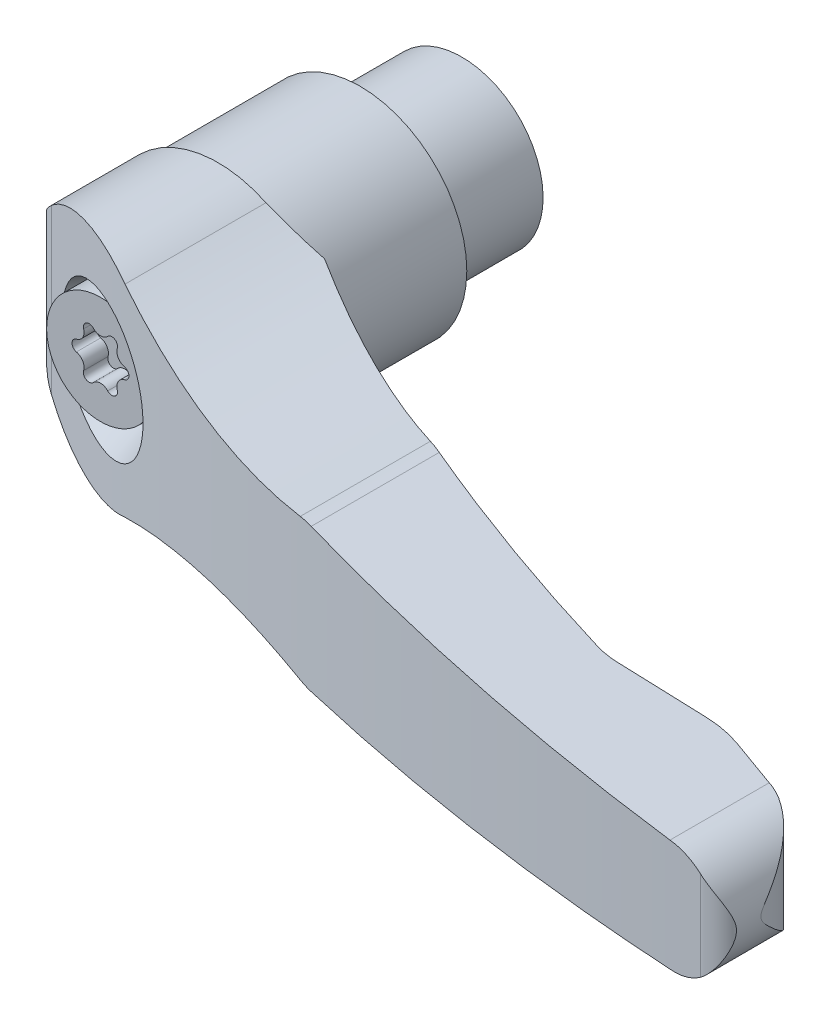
ISO-10303-21;
HEADER;
FILE_DESCRIPTION(('STEP AP214'),'2;1');
FILE_NAME('part.step','',(''),(''),'','','');
FILE_SCHEMA(('AUTOMOTIVE_DESIGN { 1 0 10303 214 1 1 1 1 }'));
ENDSEC;
DATA;
#1=APPLICATION_CONTEXT('core data for automotive mechanical design processes');
#2=APPLICATION_PROTOCOL_DEFINITION('international standard','automotive_design',2000,#1);
#3=PRODUCT_CONTEXT('',#1,'mechanical');
#4=PRODUCT('Part','Part','',(#3));
#5=PRODUCT_RELATED_PRODUCT_CATEGORY('part','',(#4));
#6=PRODUCT_DEFINITION_FORMATION('','',#4);
#7=PRODUCT_DEFINITION_CONTEXT('part definition',#1,'design');
#8=PRODUCT_DEFINITION('design','',#6,#7);
#9=PRODUCT_DEFINITION_SHAPE('','',#8);
#10=(LENGTH_UNIT() NAMED_UNIT(*) SI_UNIT(.MILLI.,.METRE.));
#11=(NAMED_UNIT(*) PLANE_ANGLE_UNIT() SI_UNIT($,.RADIAN.));
#12=(NAMED_UNIT(*) SI_UNIT($,.STERADIAN.) SOLID_ANGLE_UNIT());
#13=UNCERTAINTY_MEASURE_WITH_UNIT(LENGTH_MEASURE(1.E-05),#10,'distance_accuracy_value','');
#14=(GEOMETRIC_REPRESENTATION_CONTEXT(3) GLOBAL_UNCERTAINTY_ASSIGNED_CONTEXT((#13)) GLOBAL_UNIT_ASSIGNED_CONTEXT((#10,
#11,#12)) REPRESENTATION_CONTEXT('',''));
#15=CARTESIAN_POINT('',(0.,0.,0.));
#16=DIRECTION('',(0.,0.,1.));
#17=DIRECTION('',(1.,0.,0.));
#18=AXIS2_PLACEMENT_3D('',#15,#16,#17);
#19=CARTESIAN_POINT('',(-2.41768438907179,-0.749218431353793,33.17));
#20=DIRECTION('',(0.,0.,-1.));
#21=DIRECTION('',(0.,-1.,0.));
#22=AXIS2_PLACEMENT_3D('',#19,#20,#21);
#23=PLANE('',#22);
#24=CARTESIAN_POINT('',(-2.59536877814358,-1.49843686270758,33.17));
#25=DIRECTION('',(0.,0.,1.));
#26=DIRECTION('',(-1.,0.,0.));
#27=AXIS2_PLACEMENT_3D('',#24,#25,#26);
#28=CIRCLE('',#27,0.980000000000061);
#29=CARTESIAN_POINT('',(-1.6564977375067,-1.7793659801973,33.17));
#30=VERTEX_POINT('',#29);
#31=CARTESIAN_POINT('',(-2.369225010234,-0.544886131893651,33.17));
#32=VERTEX_POINT('',#31);
#33=EDGE_CURVE('E1234',#30,#32,#28,.T.);
#34=ORIENTED_EDGE('',*,*,#33,.F.);
#35=CARTESIAN_POINT('',(-1.12,-1.93989690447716,33.17));
#36=DIRECTION('',(0.,0.,-1.));
#37=DIRECTION('',(1.,0.,0.));
#38=AXIS2_PLACEMENT_3D('',#35,#36,#37);
#39=CIRCLE('',#38,0.559999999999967);
#40=CARTESIAN_POINT('',(-0.71272727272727,-2.3242521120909,33.17));
#41=VERTEX_POINT('',#40);
#42=EDGE_CURVE('E1233',#41,#30,#39,.T.);
#43=ORIENTED_EDGE('',*,*,#42,.F.);
#44=CARTESIAN_POINT('',(0.,-2.99687372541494,33.17));
#45=DIRECTION('',(0.,0.,1.));
#46=DIRECTION('',(-1.,0.,0.));
#47=AXIS2_PLACEMENT_3D('',#44,#45,#46);
#48=CIRCLE('',#47,0.979999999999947);
#49=CARTESIAN_POINT('',(0.71272727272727,-2.3242521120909,33.17));
#50=VERTEX_POINT('',#49);
#51=EDGE_CURVE('E1241',#50,#41,#48,.T.);
#52=ORIENTED_EDGE('',*,*,#51,.F.);
#53=CARTESIAN_POINT('',(1.12,-1.93989690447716,33.17));
#54=DIRECTION('',(0.,0.,-1.));
#55=DIRECTION('',(-1.,0.,0.));
#56=AXIS2_PLACEMENT_3D('',#53,#54,#55);
#57=CIRCLE('',#56,0.559999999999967);
#58=CARTESIAN_POINT('',(1.6564977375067,-1.7793659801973,33.17));
#59=VERTEX_POINT('',#58);
#60=EDGE_CURVE('E1245',#59,#50,#57,.T.);
#61=ORIENTED_EDGE('',*,*,#60,.F.);
#62=CARTESIAN_POINT('',(2.59536877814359,-1.49843686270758,33.17));
#63=DIRECTION('',(0.,0.,1.));
#64=DIRECTION('',(1.,0.,0.));
#65=AXIS2_PLACEMENT_3D('',#62,#63,#64);
#66=CIRCLE('',#65,0.980000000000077);
#67=CARTESIAN_POINT('',(2.369225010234,-0.54488613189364,33.17));
#68=VERTEX_POINT('',#67);
#69=EDGE_CURVE('E1249',#68,#59,#66,.T.);
#70=ORIENTED_EDGE('',*,*,#69,.F.);
#71=CARTESIAN_POINT('',(2.24,0.,33.17));
#72=DIRECTION('',(0.,0.,-1.));
#73=DIRECTION('',(-1.,0.,0.));
#74=AXIS2_PLACEMENT_3D('',#71,#72,#73);
#75=CIRCLE('',#74,0.56);
#76=CARTESIAN_POINT('',(2.369225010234,0.544886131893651,33.17));
#77=VERTEX_POINT('',#76);
#78=EDGE_CURVE('E1253',#77,#68,#75,.T.);
#79=ORIENTED_EDGE('',*,*,#78,.F.);
#80=CARTESIAN_POINT('',(2.59536877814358,1.49843686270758,33.17));
#81=DIRECTION('',(0.,0.,1.));
#82=DIRECTION('',(1.,0.,0.));
#83=AXIS2_PLACEMENT_3D('',#80,#81,#82);
#84=CIRCLE('',#83,0.980000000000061);
#85=CARTESIAN_POINT('',(1.6564977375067,1.7793659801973,33.17));
#86=VERTEX_POINT('',#85);
#87=EDGE_CURVE('E1257',#86,#77,#84,.T.);
#88=ORIENTED_EDGE('',*,*,#87,.F.);
#89=CARTESIAN_POINT('',(1.12,1.93989690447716,33.17));
#90=DIRECTION('',(0.,0.,-1.));
#91=DIRECTION('',(-1.,0.,0.));
#92=AXIS2_PLACEMENT_3D('',#89,#90,#91);
#93=CIRCLE('',#92,0.559999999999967);
#94=CARTESIAN_POINT('',(0.712727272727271,2.3242521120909,33.17));
#95=VERTEX_POINT('',#94);
#96=EDGE_CURVE('E1261',#95,#86,#93,.T.);
#97=ORIENTED_EDGE('',*,*,#96,.F.);
#98=CARTESIAN_POINT('',(0.,2.99687372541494,33.17));
#99=DIRECTION('',(0.,0.,1.));
#100=DIRECTION('',(-1.,0.,0.));
#101=AXIS2_PLACEMENT_3D('',#98,#99,#100);
#102=CIRCLE('',#101,0.979999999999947);
#103=CARTESIAN_POINT('',(-0.71272727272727,2.3242521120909,33.17));
#104=VERTEX_POINT('',#103);
#105=EDGE_CURVE('E1265',#104,#95,#102,.T.);
#106=ORIENTED_EDGE('',*,*,#105,.F.);
#107=CARTESIAN_POINT('',(-1.12,1.93989690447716,33.17));
#108=DIRECTION('',(0.,0.,-1.));
#109=DIRECTION('',(1.,0.,0.));
#110=AXIS2_PLACEMENT_3D('',#107,#108,#109);
#111=CIRCLE('',#110,0.559999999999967);
#112=CARTESIAN_POINT('',(-1.6564977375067,1.7793659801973,33.17));
#113=VERTEX_POINT('',#112);
#114=EDGE_CURVE('E1269',#113,#104,#111,.T.);
#115=ORIENTED_EDGE('',*,*,#114,.F.);
#116=CARTESIAN_POINT('',(-2.59536877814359,1.49843686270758,33.17));
#117=DIRECTION('',(0.,0.,1.));
#118=DIRECTION('',(-1.,0.,0.));
#119=AXIS2_PLACEMENT_3D('',#116,#117,#118);
#120=CIRCLE('',#119,0.980000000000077);
#121=CARTESIAN_POINT('',(-2.369225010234,0.54488613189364,33.17));
#122=VERTEX_POINT('',#121);
#123=EDGE_CURVE('E1210',#122,#113,#120,.T.);
#124=ORIENTED_EDGE('',*,*,#123,.F.);
#125=CARTESIAN_POINT('',(-2.24,0.,33.17));
#126=DIRECTION('',(0.,0.,-1.));
#127=DIRECTION('',(1.,0.,0.));
#128=AXIS2_PLACEMENT_3D('',#125,#126,#127);
#129=CIRCLE('',#128,0.56);
#130=EDGE_CURVE('E1206',#32,#122,#129,.T.);
#131=ORIENTED_EDGE('',*,*,#130,.F.);
#132=EDGE_LOOP('',(#34,#43,#52,#61,#70,#79,#88,#97,#106,#115,#124,#131));
#133=FACE_BOUND('',#132,.T.);
#134=ADVANCED_FACE('F14',(#133),#23,.F.);
#135=CARTESIAN_POINT('',(-2.59536877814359,1.49843686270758,37.97));
#136=DIRECTION('',(0.,0.,-1.));
#137=DIRECTION('',(0.,-1.,0.));
#138=AXIS2_PLACEMENT_3D('',#135,#136,#137);
#139=CYLINDRICAL_SURFACE('',#138,0.980000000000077);
#140=DIRECTION('',(0.,0.,-1.));
#141=VECTOR('',#140,1.);
#142=CARTESIAN_POINT('',(-1.6564977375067,1.7793659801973,37.97));
#143=LINE('',#142,#141);
#144=CARTESIAN_POINT('',(-1.6564977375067,1.7793659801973,35.57));
#145=VERTEX_POINT('',#144);
#146=EDGE_CURVE('E1209',#145,#113,#143,.T.);
#147=ORIENTED_EDGE('',*,*,#146,.F.);
#148=CARTESIAN_POINT('',(-2.59536877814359,1.49843686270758,35.57));
#149=DIRECTION('',(0.,0.,-1.));
#150=DIRECTION('',(0.,1.,0.));
#151=AXIS2_PLACEMENT_3D('',#148,#149,#150);
#152=CIRCLE('',#151,0.980000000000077);
#153=CARTESIAN_POINT('',(-2.369225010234,0.54488613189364,35.57));
#154=VERTEX_POINT('',#153);
#155=EDGE_CURVE('E591',#145,#154,#152,.T.);
#156=ORIENTED_EDGE('',*,*,#155,.T.);
#157=DIRECTION('',(0.,0.,-1.));
#158=VECTOR('',#157,1.);
#159=CARTESIAN_POINT('',(-2.369225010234,0.54488613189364,37.97));
#160=LINE('',#159,#158);
#161=EDGE_CURVE('E572',#154,#122,#160,.T.);
#162=ORIENTED_EDGE('',*,*,#161,.T.);
#163=ORIENTED_EDGE('',*,*,#123,.T.);
#164=EDGE_LOOP('',(#147,#156,#162,#163));
#165=FACE_BOUND('',#164,.T.);
#166=ADVANCED_FACE('F498',(#165),#139,.T.);
#167=CARTESIAN_POINT('',(-1.12,1.93989690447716,37.97));
#168=DIRECTION('',(0.,0.,-1.));
#169=DIRECTION('',(0.,-1.,0.));
#170=AXIS2_PLACEMENT_3D('',#167,#168,#169);
#171=CYLINDRICAL_SURFACE('',#170,0.559999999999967);
#172=DIRECTION('',(0.,0.,-1.));
#173=VECTOR('',#172,1.);
#174=CARTESIAN_POINT('',(-0.71272727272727,2.3242521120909,37.97));
#175=LINE('',#174,#173);
#176=CARTESIAN_POINT('',(-0.71272727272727,2.3242521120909,35.57));
#177=VERTEX_POINT('',#176);
#178=EDGE_CURVE('E1213',#177,#104,#175,.T.);
#179=ORIENTED_EDGE('',*,*,#178,.F.);
#180=CARTESIAN_POINT('',(-1.12,1.93989690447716,35.57));
#181=DIRECTION('',(0.,0.,-1.));
#182=DIRECTION('',(0.,1.,0.));
#183=AXIS2_PLACEMENT_3D('',#180,#181,#182);
#184=CIRCLE('',#183,0.559999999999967);
#185=EDGE_CURVE('E589',#177,#145,#184,.F.);
#186=ORIENTED_EDGE('',*,*,#185,.T.);
#187=ORIENTED_EDGE('',*,*,#146,.T.);
#188=ORIENTED_EDGE('',*,*,#114,.T.);
#189=EDGE_LOOP('',(#179,#186,#187,#188));
#190=FACE_BOUND('',#189,.T.);
#191=ADVANCED_FACE('F505',(#190),#171,.F.);
#192=CARTESIAN_POINT('',(0.,2.99687372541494,37.97));
#193=DIRECTION('',(0.,0.,-1.));
#194=DIRECTION('',(0.,-1.,0.));
#195=AXIS2_PLACEMENT_3D('',#192,#193,#194);
#196=CYLINDRICAL_SURFACE('',#195,0.979999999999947);
#197=DIRECTION('',(0.,0.,-1.));
#198=VECTOR('',#197,1.);
#199=CARTESIAN_POINT('',(0.712727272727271,2.3242521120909,37.97));
#200=LINE('',#199,#198);
#201=CARTESIAN_POINT('',(0.712727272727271,2.3242521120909,35.57));
#202=VERTEX_POINT('',#201);
#203=EDGE_CURVE('E1215',#202,#95,#200,.T.);
#204=ORIENTED_EDGE('',*,*,#203,.F.);
#205=CARTESIAN_POINT('',(0.,2.99687372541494,35.57));
#206=DIRECTION('',(0.,0.,-1.));
#207=DIRECTION('',(0.,1.,0.));
#208=AXIS2_PLACEMENT_3D('',#205,#206,#207);
#209=CIRCLE('',#208,0.979999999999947);
#210=EDGE_CURVE('E587',#202,#177,#209,.T.);
#211=ORIENTED_EDGE('',*,*,#210,.T.);
#212=ORIENTED_EDGE('',*,*,#178,.T.);
#213=ORIENTED_EDGE('',*,*,#105,.T.);
#214=EDGE_LOOP('',(#204,#211,#212,#213));
#215=FACE_BOUND('',#214,.T.);
#216=ADVANCED_FACE('F537',(#215),#196,.T.);
#217=CARTESIAN_POINT('',(1.12,1.93989690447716,37.97));
#218=DIRECTION('',(0.,0.,-1.));
#219=DIRECTION('',(0.,-1.,0.));
#220=AXIS2_PLACEMENT_3D('',#217,#218,#219);
#221=CYLINDRICAL_SURFACE('',#220,0.559999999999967);
#222=DIRECTION('',(0.,0.,-1.));
#223=VECTOR('',#222,1.);
#224=CARTESIAN_POINT('',(1.6564977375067,1.7793659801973,37.97));
#225=LINE('',#224,#223);
#226=CARTESIAN_POINT('',(1.6564977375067,1.7793659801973,35.57));
#227=VERTEX_POINT('',#226);
#228=EDGE_CURVE('E1219',#227,#86,#225,.T.);
#229=ORIENTED_EDGE('',*,*,#228,.F.);
#230=CARTESIAN_POINT('',(1.12,1.93989690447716,35.57));
#231=DIRECTION('',(0.,0.,-1.));
#232=DIRECTION('',(0.,1.,0.));
#233=AXIS2_PLACEMENT_3D('',#230,#231,#232);
#234=CIRCLE('',#233,0.559999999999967);
#235=EDGE_CURVE('E585',#227,#202,#234,.F.);
#236=ORIENTED_EDGE('',*,*,#235,.T.);
#237=ORIENTED_EDGE('',*,*,#203,.T.);
#238=ORIENTED_EDGE('',*,*,#96,.T.);
#239=EDGE_LOOP('',(#229,#236,#237,#238));
#240=FACE_BOUND('',#239,.T.);
#241=ADVANCED_FACE('F533',(#240),#221,.F.);
#242=CARTESIAN_POINT('',(2.59536877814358,1.49843686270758,37.97));
#243=DIRECTION('',(0.,0.,-1.));
#244=DIRECTION('',(0.,-1.,0.));
#245=AXIS2_PLACEMENT_3D('',#242,#243,#244);
#246=CYLINDRICAL_SURFACE('',#245,0.980000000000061);
#247=DIRECTION('',(0.,0.,-1.));
#248=VECTOR('',#247,1.);
#249=CARTESIAN_POINT('',(2.369225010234,0.544886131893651,37.97));
#250=LINE('',#249,#248);
#251=CARTESIAN_POINT('',(2.369225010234,0.544886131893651,35.57));
#252=VERTEX_POINT('',#251);
#253=EDGE_CURVE('E1221',#252,#77,#250,.T.);
#254=ORIENTED_EDGE('',*,*,#253,.F.);
#255=CARTESIAN_POINT('',(2.59536877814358,1.49843686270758,35.57));
#256=DIRECTION('',(0.,0.,-1.));
#257=DIRECTION('',(0.,1.,0.));
#258=AXIS2_PLACEMENT_3D('',#255,#256,#257);
#259=CIRCLE('',#258,0.980000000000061);
#260=EDGE_CURVE('E583',#252,#227,#259,.T.);
#261=ORIENTED_EDGE('',*,*,#260,.T.);
#262=ORIENTED_EDGE('',*,*,#228,.T.);
#263=ORIENTED_EDGE('',*,*,#87,.T.);
#264=EDGE_LOOP('',(#254,#261,#262,#263));
#265=FACE_BOUND('',#264,.T.);
#266=ADVANCED_FACE('F529',(#265),#246,.T.);
#267=CARTESIAN_POINT('',(2.24,0.,37.97));
#268=DIRECTION('',(0.,0.,-1.));
#269=DIRECTION('',(0.,-1.,0.));
#270=AXIS2_PLACEMENT_3D('',#267,#268,#269);
#271=CYLINDRICAL_SURFACE('',#270,0.56);
#272=DIRECTION('',(0.,0.,-1.));
#273=VECTOR('',#272,1.);
#274=CARTESIAN_POINT('',(2.369225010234,-0.54488613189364,37.97));
#275=LINE('',#274,#273);
#276=CARTESIAN_POINT('',(2.369225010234,-0.54488613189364,35.57));
#277=VERTEX_POINT('',#276);
#278=EDGE_CURVE('E1223',#277,#68,#275,.T.);
#279=ORIENTED_EDGE('',*,*,#278,.F.);
#280=CARTESIAN_POINT('',(2.24,0.,35.57));
#281=DIRECTION('',(0.,0.,-1.));
#282=DIRECTION('',(0.,1.,0.));
#283=AXIS2_PLACEMENT_3D('',#280,#281,#282);
#284=CIRCLE('',#283,0.56);
#285=EDGE_CURVE('E581',#277,#252,#284,.F.);
#286=ORIENTED_EDGE('',*,*,#285,.T.);
#287=ORIENTED_EDGE('',*,*,#253,.T.);
#288=ORIENTED_EDGE('',*,*,#78,.T.);
#289=EDGE_LOOP('',(#279,#286,#287,#288));
#290=FACE_BOUND('',#289,.T.);
#291=ADVANCED_FACE('F525',(#290),#271,.F.);
#292=CARTESIAN_POINT('',(2.59536877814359,-1.49843686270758,37.97));
#293=DIRECTION('',(0.,0.,-1.));
#294=DIRECTION('',(0.,-1.,0.));
#295=AXIS2_PLACEMENT_3D('',#292,#293,#294);
#296=CYLINDRICAL_SURFACE('',#295,0.980000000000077);
#297=DIRECTION('',(0.,0.,-1.));
#298=VECTOR('',#297,1.);
#299=CARTESIAN_POINT('',(1.6564977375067,-1.7793659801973,37.97));
#300=LINE('',#299,#298);
#301=CARTESIAN_POINT('',(1.6564977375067,-1.7793659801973,35.57));
#302=VERTEX_POINT('',#301);
#303=EDGE_CURVE('E1225',#302,#59,#300,.T.);
#304=ORIENTED_EDGE('',*,*,#303,.F.);
#305=CARTESIAN_POINT('',(2.59536877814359,-1.49843686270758,35.57));
#306=DIRECTION('',(0.,0.,-1.));
#307=DIRECTION('',(0.,1.,0.));
#308=AXIS2_PLACEMENT_3D('',#305,#306,#307);
#309=CIRCLE('',#308,0.980000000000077);
#310=EDGE_CURVE('E579',#302,#277,#309,.T.);
#311=ORIENTED_EDGE('',*,*,#310,.T.);
#312=ORIENTED_EDGE('',*,*,#278,.T.);
#313=ORIENTED_EDGE('',*,*,#69,.T.);
#314=EDGE_LOOP('',(#304,#311,#312,#313));
#315=FACE_BOUND('',#314,.T.);
#316=ADVANCED_FACE('F521',(#315),#296,.T.);
#317=CARTESIAN_POINT('',(1.12,-1.93989690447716,37.97));
#318=DIRECTION('',(0.,0.,-1.));
#319=DIRECTION('',(0.,-1.,0.));
#320=AXIS2_PLACEMENT_3D('',#317,#318,#319);
#321=CYLINDRICAL_SURFACE('',#320,0.559999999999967);
#322=DIRECTION('',(0.,0.,-1.));
#323=VECTOR('',#322,1.);
#324=CARTESIAN_POINT('',(0.71272727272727,-2.3242521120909,37.97));
#325=LINE('',#324,#323);
#326=CARTESIAN_POINT('',(0.71272727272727,-2.3242521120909,35.57));
#327=VERTEX_POINT('',#326);
#328=EDGE_CURVE('E1227',#327,#50,#325,.T.);
#329=ORIENTED_EDGE('',*,*,#328,.F.);
#330=CARTESIAN_POINT('',(1.12,-1.93989690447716,35.57));
#331=DIRECTION('',(0.,0.,-1.));
#332=DIRECTION('',(0.,1.,0.));
#333=AXIS2_PLACEMENT_3D('',#330,#331,#332);
#334=CIRCLE('',#333,0.559999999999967);
#335=EDGE_CURVE('E577',#327,#302,#334,.F.);
#336=ORIENTED_EDGE('',*,*,#335,.T.);
#337=ORIENTED_EDGE('',*,*,#303,.T.);
#338=ORIENTED_EDGE('',*,*,#60,.T.);
#339=EDGE_LOOP('',(#329,#336,#337,#338));
#340=FACE_BOUND('',#339,.T.);
#341=ADVANCED_FACE('F517',(#340),#321,.F.);
#342=CARTESIAN_POINT('',(0.,-2.99687372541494,37.97));
#343=DIRECTION('',(0.,0.,-1.));
#344=DIRECTION('',(0.,-1.,0.));
#345=AXIS2_PLACEMENT_3D('',#342,#343,#344);
#346=CYLINDRICAL_SURFACE('',#345,0.979999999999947);
#347=DIRECTION('',(0.,0.,-1.));
#348=VECTOR('',#347,1.);
#349=CARTESIAN_POINT('',(-0.71272727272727,-2.3242521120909,37.97));
#350=LINE('',#349,#348);
#351=CARTESIAN_POINT('',(-0.71272727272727,-2.3242521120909,35.57));
#352=VERTEX_POINT('',#351);
#353=EDGE_CURVE('E1229',#352,#41,#350,.T.);
#354=ORIENTED_EDGE('',*,*,#353,.F.);
#355=CARTESIAN_POINT('',(0.,-2.99687372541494,35.57));
#356=DIRECTION('',(0.,0.,-1.));
#357=DIRECTION('',(0.,1.,0.));
#358=AXIS2_PLACEMENT_3D('',#355,#356,#357);
#359=CIRCLE('',#358,0.979999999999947);
#360=EDGE_CURVE('E570',#352,#327,#359,.T.);
#361=ORIENTED_EDGE('',*,*,#360,.T.);
#362=ORIENTED_EDGE('',*,*,#328,.T.);
#363=ORIENTED_EDGE('',*,*,#51,.T.);
#364=EDGE_LOOP('',(#354,#361,#362,#363));
#365=FACE_BOUND('',#364,.T.);
#366=ADVANCED_FACE('F514',(#365),#346,.T.);
#367=CARTESIAN_POINT('',(-1.12,-1.93989690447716,37.97));
#368=DIRECTION('',(0.,0.,-1.));
#369=DIRECTION('',(0.,-1.,0.));
#370=AXIS2_PLACEMENT_3D('',#367,#368,#369);
#371=CYLINDRICAL_SURFACE('',#370,0.559999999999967);
#372=DIRECTION('',(0.,0.,-1.));
#373=VECTOR('',#372,1.);
#374=CARTESIAN_POINT('',(-1.6564977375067,-1.7793659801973,37.97));
#375=LINE('',#374,#373);
#376=CARTESIAN_POINT('',(-1.6564977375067,-1.7793659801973,35.57));
#377=VERTEX_POINT('',#376);
#378=EDGE_CURVE('E1231',#377,#30,#375,.T.);
#379=ORIENTED_EDGE('',*,*,#378,.F.);
#380=CARTESIAN_POINT('',(-1.12,-1.93989690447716,35.57));
#381=DIRECTION('',(0.,0.,-1.));
#382=DIRECTION('',(0.,1.,0.));
#383=AXIS2_PLACEMENT_3D('',#380,#381,#382);
#384=CIRCLE('',#383,0.559999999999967);
#385=EDGE_CURVE('E113',#377,#352,#384,.F.);
#386=ORIENTED_EDGE('',*,*,#385,.T.);
#387=ORIENTED_EDGE('',*,*,#353,.T.);
#388=ORIENTED_EDGE('',*,*,#42,.T.);
#389=EDGE_LOOP('',(#379,#386,#387,#388));
#390=FACE_BOUND('',#389,.T.);
#391=ADVANCED_FACE('F510',(#390),#371,.F.);
#392=CARTESIAN_POINT('',(-2.59536877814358,-1.49843686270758,37.97));
#393=DIRECTION('',(0.,0.,-1.));
#394=DIRECTION('',(0.,-1.,0.));
#395=AXIS2_PLACEMENT_3D('',#392,#393,#394);
#396=CYLINDRICAL_SURFACE('',#395,0.980000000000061);
#397=DIRECTION('',(0.,0.,-1.));
#398=VECTOR('',#397,1.);
#399=CARTESIAN_POINT('',(-2.369225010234,-0.544886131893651,37.97));
#400=LINE('',#399,#398);
#401=CARTESIAN_POINT('',(-2.369225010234,-0.544886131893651,35.57));
#402=VERTEX_POINT('',#401);
#403=EDGE_CURVE('E568',#402,#32,#400,.T.);
#404=ORIENTED_EDGE('',*,*,#403,.F.);
#405=CARTESIAN_POINT('',(-2.59536877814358,-1.49843686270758,35.57));
#406=DIRECTION('',(0.,0.,-1.));
#407=DIRECTION('',(0.,1.,0.));
#408=AXIS2_PLACEMENT_3D('',#405,#406,#407);
#409=CIRCLE('',#408,0.980000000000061);
#410=EDGE_CURVE('E594',#402,#377,#409,.T.);
#411=ORIENTED_EDGE('',*,*,#410,.T.);
#412=ORIENTED_EDGE('',*,*,#378,.T.);
#413=ORIENTED_EDGE('',*,*,#33,.T.);
#414=EDGE_LOOP('',(#404,#411,#412,#413));
#415=FACE_BOUND('',#414,.T.);
#416=ADVANCED_FACE('F513',(#415),#396,.T.);
#417=CARTESIAN_POINT('',(-2.24,0.,37.97));
#418=DIRECTION('',(0.,0.,-1.));
#419=DIRECTION('',(0.,-1.,0.));
#420=AXIS2_PLACEMENT_3D('',#417,#418,#419);
#421=CYLINDRICAL_SURFACE('',#420,0.56);
#422=ORIENTED_EDGE('',*,*,#161,.F.);
#423=CARTESIAN_POINT('',(-2.24,0.,35.57));
#424=DIRECTION('',(0.,0.,-1.));
#425=DIRECTION('',(0.,1.,0.));
#426=AXIS2_PLACEMENT_3D('',#423,#424,#425);
#427=CIRCLE('',#426,0.56);
#428=EDGE_CURVE('E106',#154,#402,#427,.F.);
#429=ORIENTED_EDGE('',*,*,#428,.T.);
#430=ORIENTED_EDGE('',*,*,#403,.T.);
#431=ORIENTED_EDGE('',*,*,#130,.T.);
#432=EDGE_LOOP('',(#422,#429,#430,#431));
#433=FACE_BOUND('',#432,.T.);
#434=ADVANCED_FACE('F545',(#433),#421,.F.);
#435=CARTESIAN_POINT('',(0.,0.,35.57));
#436=DIRECTION('',(0.,0.,1.));
#437=DIRECTION('',(0.,1.,0.));
#438=AXIS2_PLACEMENT_3D('',#435,#436,#437);
#439=PLANE('',#438);
#440=CARTESIAN_POINT('',(0.,0.,35.57));
#441=DIRECTION('',(0.,0.,-1.));
#442=DIRECTION('',(0.,1.,0.));
#443=AXIS2_PLACEMENT_3D('',#440,#441,#442);
#444=CIRCLE('',#443,5.3);
#445=CARTESIAN_POINT('',(0.,5.3,35.57));
#446=VERTEX_POINT('',#445);
#447=EDGE_CURVE('E566',#446,#446,#444,.T.);
#448=ORIENTED_EDGE('',*,*,#447,.F.);
#449=EDGE_LOOP('',(#448));
#450=FACE_BOUND('',#449,.T.);
#451=ORIENTED_EDGE('',*,*,#428,.F.);
#452=ORIENTED_EDGE('',*,*,#155,.F.);
#453=ORIENTED_EDGE('',*,*,#185,.F.);
#454=ORIENTED_EDGE('',*,*,#210,.F.);
#455=ORIENTED_EDGE('',*,*,#235,.F.);
#456=ORIENTED_EDGE('',*,*,#260,.F.);
#457=ORIENTED_EDGE('',*,*,#285,.F.);
#458=ORIENTED_EDGE('',*,*,#310,.F.);
#459=ORIENTED_EDGE('',*,*,#335,.F.);
#460=ORIENTED_EDGE('',*,*,#360,.F.);
#461=ORIENTED_EDGE('',*,*,#385,.F.);
#462=ORIENTED_EDGE('',*,*,#410,.F.);
#463=EDGE_LOOP('',(#451,#452,#453,#454,#455,#456,#457,#458,#459,#460,#461,#462));
#464=FACE_BOUND('',#463,.T.);
#465=ADVANCED_FACE('F16',(#450,#464),#439,.T.);
#466=CARTESIAN_POINT('',(79.9967051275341,12.,50.539592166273));
#467=DIRECTION('',(-0.992331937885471,0.,0.123601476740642));
#468=DIRECTION('',(-0.123601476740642,0.,-0.99233193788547));
#469=AXIS2_PLACEMENT_3D('',#466,#467,#468);
#470=PLANE('',#469);
#471=CARTESIAN_POINT('',(74.5,0.,6.40940703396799));
#472=DIRECTION('',(0.992331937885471,0.,-0.123601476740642));
#473=DIRECTION('',(0.123601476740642,0.,0.99233193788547));
#474=AXIS2_PLACEMENT_3D('',#471,#472,#473);
#475=ELLIPSE('',#474,44.4978502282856,5.5);
#476=CARTESIAN_POINT('',(79.996705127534,0.190348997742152,50.539592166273));
#477=VERTEX_POINT('',#476);
#478=CARTESIAN_POINT('',(79.9967051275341,-0.190348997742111,50.539592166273));
#479=VERTEX_POINT('',#478);
#480=EDGE_CURVE('E415',#477,#479,#475,.T.);
#481=ORIENTED_EDGE('',*,*,#480,.T.);
#482=DIRECTION('',(0.,-1.,0.));
#483=VECTOR('',#482,1.);
#484=CARTESIAN_POINT('',(79.9967051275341,12.,50.539592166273));
#485=LINE('',#484,#483);
#486=EDGE_CURVE('E666',#477,#479,#485,.T.);
#487=ORIENTED_EDGE('',*,*,#486,.F.);
#488=EDGE_LOOP('',(#481,#487));
#489=FACE_BOUND('',#488,.T.);
#490=ADVANCED_FACE('F426',(#489),#470,.F.);
#491=CARTESIAN_POINT('',(72.6137555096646,12.,51.4591871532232));
#492=DIRECTION('',(0.,-1.,0.));
#493=DIRECTION('',(-1.,0.,0.));
#494=AXIS2_PLACEMENT_3D('',#491,#492,#493);
#495=CYLINDRICAL_SURFACE('',#494,7.44000000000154);
#496=CARTESIAN_POINT('',(74.986812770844,5.47841339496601,44.407790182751));
#497=CARTESIAN_POINT('',(75.1398120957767,5.46484028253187,44.4592429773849));
#498=CARTESIAN_POINT('',(75.2905169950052,5.44496899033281,44.5155387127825));
#499=CARTESIAN_POINT('',(75.5860882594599,5.39377415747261,44.6368581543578));
#500=CARTESIAN_POINT('',(75.730963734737,5.36246932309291,44.7018674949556));
#501=CARTESIAN_POINT('',(76.0125967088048,5.28989557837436,44.8390817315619));
#502=CARTESIAN_POINT('',(76.1494251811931,5.24873835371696,44.9112009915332));
#503=CARTESIAN_POINT('',(76.4161065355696,5.15736483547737,45.062373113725));
#504=CARTESIAN_POINT('',(76.5459558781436,5.10714400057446,45.1414294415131));
#505=CARTESIAN_POINT('',(76.827653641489,4.98604991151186,45.3247681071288));
#506=CARTESIAN_POINT('',(76.977577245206,4.91309116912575,45.4306358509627));
#507=CARTESIAN_POINT('',(77.2657899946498,4.7568157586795,45.6501400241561));
#508=CARTESIAN_POINT('',(77.4040776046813,4.67349772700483,45.7637774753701));
#509=CARTESIAN_POINT('',(77.8028296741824,4.409456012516,46.1156758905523));
#510=CARTESIAN_POINT('',(78.0457801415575,4.21527563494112,46.3639882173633));
#511=CARTESIAN_POINT('',(78.4176945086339,3.86589184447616,46.7984433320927));
#512=CARTESIAN_POINT('',(78.558647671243,3.71726415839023,46.9799982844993));
#513=CARTESIAN_POINT('',(78.8199419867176,3.41009407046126,47.3496806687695));
#514=CARTESIAN_POINT('',(78.9402736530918,3.25154715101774,47.5378110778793));
#515=CARTESIAN_POINT('',(79.1607378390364,2.92676895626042,47.9181651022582));
#516=CARTESIAN_POINT('',(79.2609186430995,2.76055725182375,48.1103776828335));
#517=CARTESIAN_POINT('',(79.4421677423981,2.42115236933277,48.497428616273));
#518=CARTESIAN_POINT('',(79.5232445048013,2.2479623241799,48.6922657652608));
#519=CARTESIAN_POINT('',(79.6578968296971,1.91676087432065,49.057810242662));
#520=CARTESIAN_POINT('',(79.713648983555,1.75958096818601,49.2284695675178));
#521=CARTESIAN_POINT('',(79.7869638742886,1.5182514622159,49.4826945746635));
#522=CARTESIAN_POINT('',(79.8097141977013,1.43673320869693,49.5672896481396));
#523=CARTESIAN_POINT('',(79.8517302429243,1.27132927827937,49.7350141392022));
#524=CARTESIAN_POINT('',(79.8709966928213,1.18744410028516,49.8181438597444));
#525=CARTESIAN_POINT('',(79.9071865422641,1.01046435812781,49.986973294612));
#526=CARTESIAN_POINT('',(79.9238666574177,0.917129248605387,50.0724723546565));
#527=CARTESIAN_POINT('',(79.9529450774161,0.724505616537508,50.2358460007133));
#528=CARTESIAN_POINT('',(79.9653823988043,0.625281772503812,50.3137850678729));
#529=CARTESIAN_POINT('',(79.9802376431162,0.468580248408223,50.4153149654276));
#530=CARTESIAN_POINT('',(79.9845030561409,0.416215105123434,50.4460963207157));
#531=CARTESIAN_POINT('',(79.9917045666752,0.306879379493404,50.4998809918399));
#532=CARTESIAN_POINT('',(79.9946243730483,0.249861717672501,50.5227881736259));
#533=CARTESIAN_POINT('',(79.996705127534,0.190348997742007,50.539592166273));
#534=B_SPLINE_CURVE_WITH_KNOTS('',3,(#496,#497,#498,#499,#500,#501,#502,#503,#504,#505,#506,
#507,#508,#509,#510,#511,#512,#513,#514,#515,#516,#517,#518,#519,#520,#521,#522,#523,#524,#525,
#526,#527,#528,#529,#530,#531,#532,#533),.UNSPECIFIED.,.F.,.F.,(4,2,2,2,2,2,2,2,2,2,2,2,2,2,2,2,
2,2,4),(0.,0.485611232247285,0.970431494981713,1.44999646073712,1.92980238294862,
2.52141817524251,3.11311192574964,4.30183389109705,5.12208341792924,5.9427092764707,
6.76134473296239,7.57961667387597,8.29494630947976,8.6538774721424,9.01273353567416,
9.39561932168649,9.77488268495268,9.95698827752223,10.1412441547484),.UNSPECIFIED.);
#535=CARTESIAN_POINT('',(74.986812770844,5.47841339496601,44.407790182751));
#536=VERTEX_POINT('',#535);
#537=EDGE_CURVE('E414',#536,#477,#534,.T.);
#538=ORIENTED_EDGE('',*,*,#537,.T.);
#539=ORIENTED_EDGE('',*,*,#486,.T.);
#540=CARTESIAN_POINT('',(79.996705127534,-0.190348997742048,50.539592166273));
#541=CARTESIAN_POINT('',(79.9951469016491,-0.235214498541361,50.5270575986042));
#542=CARTESIAN_POINT('',(79.9930953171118,-0.278736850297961,50.5108629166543));
#543=CARTESIAN_POINT('',(79.9881648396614,-0.363077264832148,50.4732708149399));
#544=CARTESIAN_POINT('',(79.9852922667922,-0.403913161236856,50.4519133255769));
#545=CARTESIAN_POINT('',(79.9757020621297,-0.52245816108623,50.3833482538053));
#546=CARTESIAN_POINT('',(79.9679715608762,-0.597169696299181,50.3312876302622));
#547=CARTESIAN_POINT('',(79.950886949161,-0.736456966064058,50.225155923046));
#548=CARTESIAN_POINT('',(79.9416856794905,-0.801375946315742,50.1714851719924));
#549=CARTESIAN_POINT('',(79.9214540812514,-0.928420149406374,50.0612288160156));
#550=CARTESIAN_POINT('',(79.9104232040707,-0.990544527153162,50.0046423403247));
#551=CARTESIAN_POINT('',(79.8746515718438,-1.17419942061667,49.832312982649));
#552=CARTESIAN_POINT('',(79.847248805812,-1.29287988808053,49.7141099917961));
#553=CARTESIAN_POINT('',(79.7848398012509,-1.52823594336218,49.4729704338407));
#554=CARTESIAN_POINT('',(79.7496926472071,-1.64482416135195,49.3499864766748));
#555=CARTESIAN_POINT('',(79.672100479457,-1.87458318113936,49.1033284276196));
#556=CARTESIAN_POINT('',(79.6296610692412,-1.98775652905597,48.9796549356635));
#557=CARTESIAN_POINT('',(79.5033816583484,-2.29352791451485,48.641550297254));
#558=CARTESIAN_POINT('',(79.4120558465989,-2.48329449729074,48.4272966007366));
#559=CARTESIAN_POINT('',(79.2061355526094,-2.85434488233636,48.0023120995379));
#560=CARTESIAN_POINT('',(79.0915236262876,-3.0356221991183,47.791584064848));
#561=CARTESIAN_POINT('',(78.8390032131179,-3.38665877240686,47.3777391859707));
#562=CARTESIAN_POINT('',(78.7012752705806,-3.55649399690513,47.174577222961));
#563=CARTESIAN_POINT('',(78.4009143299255,-3.88356808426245,46.7768350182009));
#564=CARTESIAN_POINT('',(78.2383021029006,-4.04081728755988,46.5822477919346));
#565=CARTESIAN_POINT('',(77.9568022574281,-4.28016983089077,46.279450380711));
#566=CARTESIAN_POINT('',(77.8461272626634,-4.36735584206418,46.1675710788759));
#567=CARTESIAN_POINT('',(77.6151298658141,-4.53501217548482,45.9487274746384));
#568=CARTESIAN_POINT('',(77.4948054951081,-4.61548112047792,45.8417641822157));
#569=CARTESIAN_POINT('',(77.2447591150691,-4.76840923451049,45.6339165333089));
#570=CARTESIAN_POINT('',(77.1150589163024,-4.84088606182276,45.5330190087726));
#571=CARTESIAN_POINT('',(76.846172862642,-4.97676025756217,45.3380932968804));
#572=CARTESIAN_POINT('',(76.7069926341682,-5.04016294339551,45.2440611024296));
#573=CARTESIAN_POINT('',(76.4438690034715,-5.14664435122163,45.0792448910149));
#574=CARTESIAN_POINT('',(76.3213555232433,-5.1913458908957,45.0072256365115));
#575=CARTESIAN_POINT('',(76.0703754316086,-5.2726954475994,44.8693561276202));
#576=CARTESIAN_POINT('',(75.9419112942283,-5.30934677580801,44.8035033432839));
#577=CARTESIAN_POINT('',(75.6784961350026,-5.37397975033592,44.6781572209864));
#578=CARTESIAN_POINT('',(75.543502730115,-5.40189236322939,44.6187168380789));
#579=CARTESIAN_POINT('',(75.2686009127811,-5.44782102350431,44.5073869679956));
#580=CARTESIAN_POINT('',(75.1286862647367,-5.46582399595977,44.455507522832));
#581=CARTESIAN_POINT('',(74.986812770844,-5.47841339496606,44.407790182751));
#582=B_SPLINE_CURVE_WITH_KNOTS('',3,(#540,#541,#542,#543,#544,#545,#546,#547,#548,#549,#550,
#551,#552,#553,#554,#555,#556,#557,#558,#559,#560,#561,#562,#563,#564,#565,#566,#567,#568,#569,
#570,#571,#572,#573,#574,#575,#576,#577,#578,#579,#580,#581),.UNSPECIFIED.,.F.,.F.,(4,2,2,2,2,2,
2,2,2,2,2,2,2,2,2,2,2,2,2,2,4),(0.,0.139245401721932,0.277446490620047,0.550810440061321,
0.80490688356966,1.05907965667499,1.56794086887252,2.08696422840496,2.60559053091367,
3.5058215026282,4.40672935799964,5.30090298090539,6.19433426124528,6.73367946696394,
7.27313498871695,7.81137365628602,8.34929561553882,8.79580649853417,9.24213337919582,
9.69190199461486,10.1422626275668),.UNSPECIFIED.);
#583=CARTESIAN_POINT('',(74.986812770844,-5.47841339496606,44.407790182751));
#584=VERTEX_POINT('',#583);
#585=EDGE_CURVE('E407',#479,#584,#582,.T.);
#586=ORIENTED_EDGE('',*,*,#585,.T.);
#587=DIRECTION('',(0.,-1.,0.));
#588=VECTOR('',#587,1.);
#589=CARTESIAN_POINT('',(74.986812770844,12.,44.407790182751));
#590=LINE('',#589,#588);
#591=EDGE_CURVE('E669',#536,#584,#590,.T.);
#592=ORIENTED_EDGE('',*,*,#591,.F.);
#593=EDGE_LOOP('',(#538,#539,#586,#592));
#594=FACE_BOUND('',#593,.T.);
#595=ADVANCED_FACE('F421',(#594),#495,.T.);
#596=CARTESIAN_POINT('',(0.,0.,10.));
#597=DIRECTION('',(0.,0.,1.));
#598=DIRECTION('',(0.,1.,0.));
#599=AXIS2_PLACEMENT_3D('',#596,#597,#598);
#600=CYLINDRICAL_SURFACE('',#599,5.3);
#601=CARTESIAN_POINT('',(0.,0.,32.75));
#602=DIRECTION('',(0.,0.,-1.));
#603=DIRECTION('',(0.,1.,0.));
#604=AXIS2_PLACEMENT_3D('',#601,#602,#603);
#605=CIRCLE('',#604,5.3);
#606=CARTESIAN_POINT('',(0.,5.3,32.75));
#607=VERTEX_POINT('',#606);
#608=EDGE_CURVE('E563',#607,#607,#605,.T.);
#609=ORIENTED_EDGE('',*,*,#608,.F.);
#610=EDGE_LOOP('',(#609));
#611=FACE_BOUND('',#610,.T.);
#612=ORIENTED_EDGE('',*,*,#447,.T.);
#613=EDGE_LOOP('',(#612));
#614=FACE_BOUND('',#613,.T.);
#615=ADVANCED_FACE('F425',(#611,#614),#600,.T.);
#616=CARTESIAN_POINT('',(57.3760512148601,12.,42.06));
#617=DIRECTION('',(0.,0.,1.));
#618=DIRECTION('',(0.,1.,0.));
#619=AXIS2_PLACEMENT_3D('',#616,#617,#618);
#620=PLANE('',#619);
#621=DIRECTION('',(-0.999347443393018,-0.0361204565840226,0.));
#622=VECTOR('',#621,1.);
#623=CARTESIAN_POINT('',(58.0300881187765,-6.09528919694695,42.06));
#624=LINE('',#623,#622);
#625=CARTESIAN_POINT('',(66.1633245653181,-5.80132115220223,42.06));
#626=VERTEX_POINT('',#625);
#627=CARTESIAN_POINT('',(57.37605121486,-6.11892873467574,42.06));
#628=VERTEX_POINT('',#627);
#629=EDGE_CURVE('E687',#626,#628,#624,.T.);
#630=ORIENTED_EDGE('',*,*,#629,.T.);
#631=DIRECTION('',(0.,-1.,0.));
#632=VECTOR('',#631,1.);
#633=CARTESIAN_POINT('',(57.3760512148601,12.,42.06));
#634=LINE('',#633,#632);
#635=CARTESIAN_POINT('',(57.37605121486,6.11892873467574,42.06));
#636=VERTEX_POINT('',#635);
#637=EDGE_CURVE('E269',#636,#628,#634,.T.);
#638=ORIENTED_EDGE('',*,*,#637,.F.);
#639=DIRECTION('',(0.999347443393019,-0.036120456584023,0.));
#640=VECTOR('',#639,1.);
#641=CARTESIAN_POINT('',(57.1637628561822,6.12660169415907,42.06));
#642=LINE('',#641,#640);
#643=CARTESIAN_POINT('',(66.163324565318,5.80132115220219,42.06));
#644=VERTEX_POINT('',#643);
#645=EDGE_CURVE('E712',#636,#644,#642,.T.);
#646=ORIENTED_EDGE('',*,*,#645,.T.);
#647=DIRECTION('',(0.,-1.,0.));
#648=VECTOR('',#647,1.);
#649=CARTESIAN_POINT('',(66.163324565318,12.,42.06));
#650=LINE('',#649,#648);
#651=EDGE_CURVE('E675',#644,#626,#650,.T.);
#652=ORIENTED_EDGE('',*,*,#651,.T.);
#653=EDGE_LOOP('',(#630,#638,#646,#652));
#654=FACE_BOUND('',#653,.T.);
#655=ADVANCED_FACE('F436',(#654),#620,.F.);
#656=CARTESIAN_POINT('',(66.1633245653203,12.,53.3399999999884));
#657=DIRECTION('',(0.,-1.,0.));
#658=DIRECTION('',(-1.,0.,0.));
#659=AXIS2_PLACEMENT_3D('',#656,#657,#658);
#660=CYLINDRICAL_SURFACE('',#659,11.2799999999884);
#661=CARTESIAN_POINT('',(66.1633245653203,-5.80132115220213,53.3399999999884));
#662=DIRECTION('',(-0.0361204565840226,0.999347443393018,0.));
#663=DIRECTION('',(-0.999347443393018,-0.0361204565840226,0.));
#664=AXIS2_PLACEMENT_3D('',#661,#662,#663);
#665=ELLIPSE('',#664,11.2873656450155,11.2799999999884);
#666=CARTESIAN_POINT('',(69.761185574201,-5.67127991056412,42.649172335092));
#667=VERTEX_POINT('',#666);
#668=EDGE_CURVE('E690',#667,#626,#665,.T.);
#669=ORIENTED_EDGE('',*,*,#668,.T.);
#670=ORIENTED_EDGE('',*,*,#651,.F.);
#671=CARTESIAN_POINT('',(66.1633245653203,5.80132115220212,53.3399999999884));
#672=DIRECTION('',(-0.036120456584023,-0.999347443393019,0.));
#673=DIRECTION('',(0.999347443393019,-0.036120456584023,0.));
#674=AXIS2_PLACEMENT_3D('',#671,#672,#673);
#675=ELLIPSE('',#674,11.2873656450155,11.2799999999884);
#676=CARTESIAN_POINT('',(69.761185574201,5.67127991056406,42.649172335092));
#677=VERTEX_POINT('',#676);
#678=EDGE_CURVE('E716',#644,#677,#675,.T.);
#679=ORIENTED_EDGE('',*,*,#678,.T.);
#680=DIRECTION('',(0.,-1.,0.));
#681=VECTOR('',#680,1.);
#682=CARTESIAN_POINT('',(69.761185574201,12.,42.649172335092));
#683=LINE('',#682,#681);
#684=EDGE_CURVE('E672',#677,#667,#683,.T.);
#685=ORIENTED_EDGE('',*,*,#684,.T.);
#686=EDGE_LOOP('',(#669,#670,#679,#685));
#687=FACE_BOUND('',#686,.T.);
#688=ADVANCED_FACE('F432',(#687),#660,.T.);
#689=CARTESIAN_POINT('',(69.761185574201,12.,42.649172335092));
#690=DIRECTION('',(-0.318959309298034,0.,0.947768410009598));
#691=DIRECTION('',(-0.947768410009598,0.,-0.318959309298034));
#692=AXIS2_PLACEMENT_3D('',#689,#690,#691);
#693=PLANE('',#692);
#694=DIRECTION('',(-0.947212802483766,-0.0342360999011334,-0.318772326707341));
#695=VECTOR('',#694,1.);
#696=CARTESIAN_POINT('',(70.3342452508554,-5.65056721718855,42.8420282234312));
#697=LINE('',#696,#695);
#698=CARTESIAN_POINT('',(74.5,-5.5,44.2439595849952));
#699=VERTEX_POINT('',#698);
#700=EDGE_CURVE('E692',#699,#667,#697,.T.);
#701=ORIENTED_EDGE('',*,*,#700,.T.);
#702=ORIENTED_EDGE('',*,*,#684,.F.);
#703=DIRECTION('',(0.947212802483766,-0.0342360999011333,0.318772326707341));
#704=VECTOR('',#703,1.);
#705=CARTESIAN_POINT('',(69.5559523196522,5.67869787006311,42.5801037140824));
#706=LINE('',#705,#704);
#707=CARTESIAN_POINT('',(74.5,5.5,44.2439595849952));
#708=VERTEX_POINT('',#707);
#709=EDGE_CURVE('E718',#677,#708,#706,.T.);
#710=ORIENTED_EDGE('',*,*,#709,.T.);
#711=CARTESIAN_POINT('',(74.5,0.,44.2439595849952));
#712=DIRECTION('',(0.318959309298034,0.,-0.947768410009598));
#713=DIRECTION('',(0.947768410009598,0.,0.318959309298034));
#714=AXIS2_PLACEMENT_3D('',#711,#712,#713);
#715=ELLIPSE('',#714,5.80310542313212,5.5);
#716=EDGE_CURVE('E696',#708,#536,#715,.T.);
#717=ORIENTED_EDGE('',*,*,#716,.T.);
#718=ORIENTED_EDGE('',*,*,#591,.T.);
#719=EDGE_CURVE('E695',#584,#699,#715,.T.);
#720=ORIENTED_EDGE('',*,*,#719,.T.);
#721=EDGE_LOOP('',(#701,#702,#710,#717,#718,#720));
#722=FACE_BOUND('',#721,.T.);
#723=ADVANCED_FACE('F428',(#722),#693,.F.);
#724=CARTESIAN_POINT('',(77.9746679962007,12.,52.1048483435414));
#725=DIRECTION('',(0.,-1.,0.));
#726=DIRECTION('',(-1.,0.,0.));
#727=AXIS2_PLACEMENT_3D('',#724,#725,#726);
#728=CYLINDRICAL_SURFACE('',#727,2.20000000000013);
#729=CARTESIAN_POINT('',(77.798742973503,-4.40094248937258,54.297803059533));
#730=CARTESIAN_POINT('',(77.873929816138,-4.34461033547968,54.3038288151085));
#731=CARTESIAN_POINT('',(77.9477917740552,-4.28621521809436,54.3058709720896));
#732=CARTESIAN_POINT('',(78.0922208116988,-4.16589830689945,54.3028912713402));
#733=CARTESIAN_POINT('',(78.1627937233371,-4.10398322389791,54.2978824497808));
#734=CARTESIAN_POINT('',(78.2996338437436,-3.97761161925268,54.2817956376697));
#735=CARTESIAN_POINT('',(78.3659353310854,-3.91318450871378,54.2707752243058));
#736=CARTESIAN_POINT('',(78.4947211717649,-3.78162408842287,54.2435114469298));
#737=CARTESIAN_POINT('',(78.5572032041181,-3.71448917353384,54.2272649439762));
#738=CARTESIAN_POINT('',(78.7037263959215,-3.54901721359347,54.182483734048));
#739=CARTESIAN_POINT('',(78.7857223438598,-3.44948168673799,54.1516573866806));
#740=CARTESIAN_POINT('',(78.94144114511,-3.24653335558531,54.0828783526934));
#741=CARTESIAN_POINT('',(79.0151615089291,-3.14311939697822,54.0449235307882));
#742=CARTESIAN_POINT('',(79.2246832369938,-2.82692774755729,53.9224540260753));
#743=CARTESIAN_POINT('',(79.3481089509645,-2.60904238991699,53.8295883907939));
#744=CARTESIAN_POINT('',(79.5118173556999,-2.2690410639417,53.6805956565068));
#745=CARTESIAN_POINT('',(79.5637254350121,-2.15065893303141,53.6280001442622));
#746=CARTESIAN_POINT('',(79.6590195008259,-1.91080459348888,53.5218995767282));
#747=CARTESIAN_POINT('',(79.7024022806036,-1.789331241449,53.4683941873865));
#748=CARTESIAN_POINT('',(79.7806945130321,-1.54303752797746,53.3628544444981));
#749=CARTESIAN_POINT('',(79.8156035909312,-1.41821701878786,53.310820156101));
#750=CARTESIAN_POINT('',(79.8768533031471,-1.16468164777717,53.2116769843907));
#751=CARTESIAN_POINT('',(79.9031999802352,-1.03596960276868,53.1645646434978));
#752=CARTESIAN_POINT('',(79.9502292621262,-0.753846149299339,53.0744438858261));
#753=CARTESIAN_POINT('',(79.9694918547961,-0.599603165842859,53.0330810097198));
#754=CARTESIAN_POINT('',(79.9884623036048,-0.364537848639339,52.9907827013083));
#755=CARTESIAN_POINT('',(79.993132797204,-0.285927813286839,52.9799792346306));
#756=CARTESIAN_POINT('',(79.9990802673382,-0.12789817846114,52.9661347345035));
#757=CARTESIAN_POINT('',(80.0003586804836,-0.0484789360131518,52.9630904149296));
#758=CARTESIAN_POINT('',(79.9994656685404,0.110643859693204,52.9651940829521));
#759=CARTESIAN_POINT('',(79.9972760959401,0.19034671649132,52.9703851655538));
#760=CARTESIAN_POINT('',(79.9895067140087,0.34872980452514,52.9883178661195));
#761=CARTESIAN_POINT('',(79.983925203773,0.427409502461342,53.001063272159));
#762=CARTESIAN_POINT('',(79.9622241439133,0.662630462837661,53.0486779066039));
#763=CARTESIAN_POINT('',(79.9411622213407,0.816788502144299,53.0928557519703));
#764=CARTESIAN_POINT('',(79.8883952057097,1.11212828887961,53.191422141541));
#765=CARTESIAN_POINT('',(79.85716938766,1.25358307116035,53.245309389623));
#766=CARTESIAN_POINT('',(79.7842829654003,1.53200335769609,53.3577691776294));
#767=CARTESIAN_POINT('',(79.74261300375,1.66896471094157,53.4163458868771));
#768=CARTESIAN_POINT('',(79.6489027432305,1.93886019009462,53.5340438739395));
#769=CARTESIAN_POINT('',(79.5968732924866,2.07179836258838,53.5931645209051));
#770=CARTESIAN_POINT('',(79.4822877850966,2.3339378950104,53.709135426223));
#771=CARTESIAN_POINT('',(79.4197377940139,2.46314135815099,53.7659869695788));
#772=CARTESIAN_POINT('',(79.2437827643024,2.79266636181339,53.9072079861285));
#773=CARTESIAN_POINT('',(79.1220745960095,2.99022899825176,53.988148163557));
#774=CARTESIAN_POINT('',(78.9187262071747,3.27696925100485,54.0934544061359));
#775=CARTESIAN_POINT('',(78.8476226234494,3.37079169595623,54.1258294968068));
#776=CARTESIAN_POINT('',(78.6984500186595,3.55485935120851,54.1839198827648));
#777=CARTESIAN_POINT('',(78.6203863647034,3.64510724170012,54.2096402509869));
#778=CARTESIAN_POINT('',(78.4833241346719,3.79339526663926,54.2460114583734));
#779=CARTESIAN_POINT('',(78.4261294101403,3.85257392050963,54.2588546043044));
#780=CARTESIAN_POINT('',(78.3087404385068,3.96866565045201,54.2801534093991));
#781=CARTESIAN_POINT('',(78.2485476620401,4.02557981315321,54.2886111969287));
#782=CARTESIAN_POINT('',(78.1248892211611,4.13728909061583,54.300599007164));
#783=CARTESIAN_POINT('',(78.0614020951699,4.19206473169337,54.30409095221));
#784=CARTESIAN_POINT('',(77.9318740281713,4.29875909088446,54.3053863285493));
#785=CARTESIAN_POINT('',(77.8658296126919,4.35067367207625,54.3031817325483));
#786=CARTESIAN_POINT('',(77.798742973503,4.40094248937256,54.297803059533));
#787=B_SPLINE_CURVE_WITH_KNOTS('',3,(#729,#730,#731,#732,#733,#734,#735,#736,#737,#738,#739,
#740,#741,#742,#743,#744,#745,#746,#747,#748,#749,#750,#751,#752,#753,#754,#755,#756,#757,#758,
#759,#760,#761,#762,#763,#764,#765,#766,#767,#768,#769,#770,#771,#772,#773,#774,#775,#776,#777,
#778,#779,#780,#781,#782,#783,#784,#785,#786),.UNSPECIFIED.,.F.,.F.,(4,2,2,2,2,2,2,2,2,2,2,2,2,
2,2,2,2,2,2,2,2,2,2,2,2,2,2,2,4),(0.,0.282196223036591,0.563871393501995,0.842894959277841,
1.12208642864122,1.51924084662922,1.91651441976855,2.71446317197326,3.13292824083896,
3.551550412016,3.97019109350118,4.38853568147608,4.86893910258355,5.1070079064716,
5.34497586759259,5.58419320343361,5.82353059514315,6.30682886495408,6.77001918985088,
7.23362600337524,7.6967498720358,8.15960763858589,8.8940807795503,9.26002910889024,
9.6256976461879,9.87541390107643,10.1250088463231,10.3765075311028,10.6283608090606),.UNSPECIFIED.);
#788=CARTESIAN_POINT('',(77.798742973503,-4.40094248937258,54.297803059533));
#789=VERTEX_POINT('',#788);
#790=CARTESIAN_POINT('',(77.798742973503,4.40094248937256,54.297803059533));
#791=VERTEX_POINT('',#790);
#792=EDGE_CURVE('E399',#789,#791,#787,.T.);
#793=ORIENTED_EDGE('',*,*,#792,.T.);
#794=DIRECTION('',(0.,-1.,0.));
#795=VECTOR('',#794,1.);
#796=CARTESIAN_POINT('',(77.798742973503,12.,54.297803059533));
#797=LINE('',#796,#795);
#798=EDGE_CURVE('E660',#791,#789,#797,.T.);
#799=ORIENTED_EDGE('',*,*,#798,.T.);
#800=EDGE_LOOP('',(#793,#799));
#801=FACE_BOUND('',#800,.T.);
#802=ADVANCED_FACE('F310',(#801),#728,.T.);
#803=CARTESIAN_POINT('',(74.5,0.,0.));
#804=DIRECTION('',(0.,0.,1.));
#805=DIRECTION('',(0.,1.,0.));
#806=AXIS2_PLACEMENT_3D('',#803,#804,#805);
#807=CYLINDRICAL_SURFACE('',#806,5.5);
#808=ORIENTED_EDGE('',*,*,#719,.F.);
#809=ORIENTED_EDGE('',*,*,#585,.F.);
#810=ORIENTED_EDGE('',*,*,#480,.F.);
#811=ORIENTED_EDGE('',*,*,#537,.F.);
#812=ORIENTED_EDGE('',*,*,#716,.F.);
#813=DIRECTION('',(0.,0.,1.));
#814=VECTOR('',#813,1.);
#815=CARTESIAN_POINT('',(74.5,5.5,0.));
#816=LINE('',#815,#814);
#817=CARTESIAN_POINT('',(74.5,5.5,54.0125431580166));
#818=VERTEX_POINT('',#817);
#819=EDGE_CURVE('E614',#708,#818,#816,.T.);
#820=ORIENTED_EDGE('',*,*,#819,.T.);
#821=CARTESIAN_POINT('',(77.798742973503,4.40094248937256,54.297803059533));
#822=CARTESIAN_POINT('',(77.6730117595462,4.49520744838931,54.2877173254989));
#823=CARTESIAN_POINT('',(77.543242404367,4.58403830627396,54.2772163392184));
#824=CARTESIAN_POINT('',(77.2766350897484,4.75025470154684,54.2554353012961));
#825=CARTESIAN_POINT('',(77.1397972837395,4.82764048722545,54.2441552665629));
#826=CARTESIAN_POINT('',(76.8637273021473,4.96851987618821,54.2211728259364));
#827=CARTESIAN_POINT('',(76.724652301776,5.03232485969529,54.2094892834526));
#828=CARTESIAN_POINT('',(76.4417304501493,5.14811004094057,54.1854893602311));
#829=CARTESIAN_POINT('',(76.2978841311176,5.2000915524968,54.1731730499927));
#830=CARTESIAN_POINT('',(76.0203147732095,5.28750909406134,54.1491735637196));
#831=CARTESIAN_POINT('',(75.8869338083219,5.32404996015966,54.137541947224));
#832=CARTESIAN_POINT('',(75.6178323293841,5.3869792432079,54.1138665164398));
#833=CARTESIAN_POINT('',(75.4821118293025,5.41336772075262,54.1018227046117));
#834=CARTESIAN_POINT('',(75.2057714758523,5.45636368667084,54.0770836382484));
#835=CARTESIAN_POINT('',(75.0651128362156,5.47271709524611,54.0643796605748));
#836=CARTESIAN_POINT('',(74.7829659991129,5.49454155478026,54.0386698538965));
#837=CARTESIAN_POINT('',(74.6414777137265,5.50001143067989,54.0256639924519));
#838=CARTESIAN_POINT('',(74.5,5.5,54.0125431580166));
#839=B_SPLINE_CURVE_WITH_KNOTS('',3,(#821,#822,#823,#824,#825,#826,#827,#828,#829,#830,#831,
#832,#833,#834,#835,#836,#837,#838),.UNSPECIFIED.,.F.,.F.,(4,2,2,2,2,2,2,2,4),(0.,
0.472256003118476,0.94450175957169,1.4043494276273,1.86414597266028,2.28011334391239,
2.69607823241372,3.12218187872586,3.54833152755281),.UNSPECIFIED.);
#840=EDGE_CURVE('E351',#791,#818,#839,.T.);
#841=ORIENTED_EDGE('',*,*,#840,.F.);
#842=ORIENTED_EDGE('',*,*,#792,.F.);
#843=CARTESIAN_POINT('',(74.5,-5.5,54.0125431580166));
#844=CARTESIAN_POINT('',(74.6569817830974,-5.50001767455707,54.0271022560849));
#845=CARTESIAN_POINT('',(74.8139774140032,-5.49327990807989,54.0415193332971));
#846=CARTESIAN_POINT('',(75.1268553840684,-5.46641140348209,54.0699741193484));
#847=CARTESIAN_POINT('',(75.2827377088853,-5.44628049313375,54.0840118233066));
#848=CARTESIAN_POINT('',(75.5881745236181,-5.39344753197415,54.1112492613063));
#849=CARTESIAN_POINT('',(75.7377876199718,-5.36108997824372,54.1244613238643));
#850=CARTESIAN_POINT('',(76.0338266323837,-5.28401004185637,54.1503568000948));
#851=CARTESIAN_POINT('',(76.1802529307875,-5.23928915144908,54.1630402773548));
#852=CARTESIAN_POINT('',(76.4548154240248,-5.14273859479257,54.1866003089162));
#853=CARTESIAN_POINT('',(76.5833420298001,-5.09202856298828,54.1975324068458));
#854=CARTESIAN_POINT('',(76.8362535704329,-4.98106305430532,54.2188651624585));
#855=CARTESIAN_POINT('',(76.9606385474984,-4.92080767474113,54.229265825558));
#856=CARTESIAN_POINT('',(77.2075247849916,-4.78950121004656,54.2497414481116));
#857=CARTESIAN_POINT('',(77.3299064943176,-4.71822304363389,54.2598023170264));
#858=CARTESIAN_POINT('',(77.5688654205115,-4.56641426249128,54.279288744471));
#859=CARTESIAN_POINT('',(77.6854418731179,-4.48588243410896,54.2887142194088));
#860=CARTESIAN_POINT('',(77.798742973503,-4.40094248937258,54.297803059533));
#861=B_SPLINE_CURVE_WITH_KNOTS('',3,(#843,#844,#845,#846,#847,#848,#849,#850,#851,#852,#853,
#854,#855,#856,#857,#858,#859,#860),.UNSPECIFIED.,.F.,.F.,(4,2,2,2,2,2,2,2,4),(0.,
0.472824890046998,0.945655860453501,1.40605305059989,1.86639469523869,2.28181230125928,
2.69722567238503,3.12275079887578,3.54833179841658),.UNSPECIFIED.);
#862=CARTESIAN_POINT('',(74.5,-5.5,54.0125431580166));
#863=VERTEX_POINT('',#862);
#864=EDGE_CURVE('E373',#863,#789,#861,.T.);
#865=ORIENTED_EDGE('',*,*,#864,.F.);
#866=DIRECTION('',(0.,0.,1.));
#867=VECTOR('',#866,1.);
#868=CARTESIAN_POINT('',(74.5,-5.5,0.));
#869=LINE('',#868,#867);
#870=EDGE_CURVE('E617',#699,#863,#869,.T.);
#871=ORIENTED_EDGE('',*,*,#870,.F.);
#872=EDGE_LOOP('',(#808,#809,#810,#811,#812,#820,#841,#842,#865,#871));
#873=FACE_BOUND('',#872,.T.);
#874=ADVANCED_FACE('F384',(#873),#807,.T.);
#875=CARTESIAN_POINT('',(0.,0.,47.));
#876=DIRECTION('',(0.,0.,1.));
#877=DIRECTION('',(0.,1.,0.));
#878=AXIS2_PLACEMENT_3D('',#875,#876,#877);
#879=CONICAL_SURFACE('',#878,10.486575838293,0.349065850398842);
#880=ORIENTED_EDGE('',*,*,#608,.T.);
#881=EDGE_LOOP('',(#880));
#882=FACE_BOUND('',#881,.T.);
#883=CARTESIAN_POINT('',(-3.08313296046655,-5.19477034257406,34.785350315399));
#884=CARTESIAN_POINT('',(-2.93971672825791,-5.30508107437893,34.8448721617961));
#885=CARTESIAN_POINT('',(-2.79218239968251,-5.40917535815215,34.9059559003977));
#886=CARTESIAN_POINT('',(-2.48989839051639,-5.60453924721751,35.0307772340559));
#887=CARTESIAN_POINT('',(-2.33514671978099,-5.69580528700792,35.0945155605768));
#888=CARTESIAN_POINT('',(-1.86124016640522,-5.9499966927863,35.289160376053));
#889=CARTESIAN_POINT('',(-1.53263655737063,-6.09316042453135,35.4234124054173));
#890=CARTESIAN_POINT('',(-0.829712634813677,-6.33431643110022,35.7088585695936));
#891=CARTESIAN_POINT('',(-0.453887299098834,-6.42738951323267,35.8605189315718));
#892=CARTESIAN_POINT('',(0.116778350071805,-6.51713718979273,36.0892493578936));
#893=CARTESIAN_POINT('',(0.30825270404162,-6.53874106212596,36.1657381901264));
#894=CARTESIAN_POINT('',(0.692358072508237,-6.56522388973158,36.3186583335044));
#895=CARTESIAN_POINT('',(0.884988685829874,-6.57010834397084,36.3950896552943));
#896=CARTESIAN_POINT('',(1.27769031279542,-6.56294299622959,36.5503740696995));
#897=CARTESIAN_POINT('',(1.47775770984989,-6.55022350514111,36.6292049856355));
#898=CARTESIAN_POINT('',(1.8762941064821,-6.50664715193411,36.785683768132));
#899=CARTESIAN_POINT('',(2.0747636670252,-6.47579696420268,36.8633320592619));
#900=CARTESIAN_POINT('',(2.46881288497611,-6.3960035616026,37.0169608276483));
#901=CARTESIAN_POINT('',(2.66439103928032,-6.34705125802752,37.0929404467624));
#902=CARTESIAN_POINT('',(3.05097140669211,-6.23122690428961,37.24260821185));
#903=CARTESIAN_POINT('',(3.24197554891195,-6.16436255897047,37.3162973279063));
#904=CARTESIAN_POINT('',(3.61554810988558,-6.01392285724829,37.459941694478));
#905=CARTESIAN_POINT('',(3.79819315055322,-5.93057203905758,37.5299326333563));
#906=CARTESIAN_POINT('',(4.15600787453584,-5.7470362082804,37.6666159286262));
#907=CARTESIAN_POINT('',(4.33118086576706,-5.64685874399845,37.733309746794));
#908=CARTESIAN_POINT('',(4.67262758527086,-5.43011008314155,37.8629172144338));
#909=CARTESIAN_POINT('',(4.83889925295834,-5.3135351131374,37.9258299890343));
#910=CARTESIAN_POINT('',(5.16085424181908,-5.06471367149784,38.0473036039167));
#911=CARTESIAN_POINT('',(5.31654277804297,-4.93247500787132,38.1058665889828));
#912=CARTESIAN_POINT('',(5.60748492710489,-4.66091599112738,38.2150185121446));
#913=CARTESIAN_POINT('',(5.74339416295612,-4.52240334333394,38.2658701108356));
#914=CARTESIAN_POINT('',(6.00309548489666,-4.23302174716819,38.362818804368));
#915=CARTESIAN_POINT('',(6.12689318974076,-4.0821585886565,38.4089181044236));
#916=CARTESIAN_POINT('',(6.36116536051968,-3.76906137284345,38.495978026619));
#917=CARTESIAN_POINT('',(6.47164172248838,-3.60682893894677,38.536939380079));
#918=CARTESIAN_POINT('',(6.67810127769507,-3.27216308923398,38.6133528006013));
#919=CARTESIAN_POINT('',(6.77408538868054,-3.09973032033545,38.648805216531));
#920=CARTESIAN_POINT('',(6.94424917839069,-2.75851487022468,38.7115628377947));
#921=CARTESIAN_POINT('',(7.01948974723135,-2.59033375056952,38.739266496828));
#922=CARTESIAN_POINT('',(7.15575170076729,-2.24754862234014,38.7893815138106));
#923=CARTESIAN_POINT('',(7.21677405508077,-2.07294505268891,38.8117932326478));
#924=CARTESIAN_POINT('',(7.32394293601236,-1.718679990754,38.851119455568));
#925=CARTESIAN_POINT('',(7.37009365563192,-1.53901993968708,38.8680355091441));
#926=CARTESIAN_POINT('',(7.44704039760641,-1.17600627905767,38.8962233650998));
#927=CARTESIAN_POINT('',(7.4778369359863,-0.992652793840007,38.9074953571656));
#928=CARTESIAN_POINT('',(7.52250454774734,-0.633633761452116,38.9238397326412));
#929=CARTESIAN_POINT('',(7.5371947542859,-0.458083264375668,38.9292121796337));
#930=CARTESIAN_POINT('',(7.55237656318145,-0.106225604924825,38.9347643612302));
#931=CARTESIAN_POINT('',(7.55286344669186,0.0700817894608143,38.9349423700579));
#932=CARTESIAN_POINT('',(7.53962429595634,0.422000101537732,38.9301007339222));
#933=CARTESIAN_POINT('',(7.52590541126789,0.597611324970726,38.9250837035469));
#934=CARTESIAN_POINT('',(7.4843960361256,0.947003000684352,38.9098957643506));
#935=CARTESIAN_POINT('',(7.4566003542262,1.12078275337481,38.8997229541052));
#936=CARTESIAN_POINT('',(7.38782379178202,1.4621494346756,38.8745322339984));
#937=CARTESIAN_POINT('',(7.34708377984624,1.62979152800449,38.8596028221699));
#938=CARTESIAN_POINT('',(7.25265637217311,1.96094624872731,38.8249647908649));
#939=CARTESIAN_POINT('',(7.19896434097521,2.12445737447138,38.8052544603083));
#940=CARTESIAN_POINT('',(7.07915543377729,2.44615230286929,38.7612185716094));
#941=CARTESIAN_POINT('',(7.01304282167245,2.60433791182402,38.7368945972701));
#942=CARTESIAN_POINT('',(6.86894369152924,2.91449829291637,38.683801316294));
#943=CARTESIAN_POINT('',(6.79095271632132,3.06647070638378,38.6550303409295));
#944=CARTESIAN_POINT('',(6.62197449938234,3.36644167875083,38.5925910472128));
#945=CARTESIAN_POINT('',(6.53074257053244,3.51428310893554,38.5588302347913));
#946=CARTESIAN_POINT('',(6.33735294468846,3.80164118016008,38.4871303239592));
#947=CARTESIAN_POINT('',(6.23519128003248,3.94115476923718,38.4491897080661));
#948=CARTESIAN_POINT('',(6.02082874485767,4.21100057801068,38.3694152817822));
#949=CARTESIAN_POINT('',(5.90863002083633,4.34133475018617,38.3275823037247));
#950=CARTESIAN_POINT('',(5.67501018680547,4.59223086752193,38.2402832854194));
#951=CARTESIAN_POINT('',(5.55358561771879,4.7127891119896,38.1948158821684));
#952=CARTESIAN_POINT('',(5.29586932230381,4.94954713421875,38.0980841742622));
#953=CARTESIAN_POINT('',(5.1591322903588,5.06519010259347,38.0466411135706));
#954=CARTESIAN_POINT('',(4.87751944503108,5.28443800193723,37.9404126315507));
#955=CARTESIAN_POINT('',(4.73264060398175,5.38803841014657,37.8856259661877));
#956=CARTESIAN_POINT('',(4.28740711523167,5.68000967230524,37.7167896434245));
#957=CARTESIAN_POINT('',(3.97626812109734,5.84972146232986,37.5981934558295));
#958=CARTESIAN_POINT('',(3.31272606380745,6.14597768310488,37.3437408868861));
#959=CARTESIAN_POINT('',(2.95895493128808,6.26888266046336,37.2072607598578));
#960=CARTESIAN_POINT('',(2.23813749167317,6.45326003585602,36.9273246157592));
#961=CARTESIAN_POINT('',(1.8710871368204,6.5147135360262,36.7838664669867));
#962=CARTESIAN_POINT('',(1.3072011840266,6.56132850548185,36.5620099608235));
#963=CARTESIAN_POINT('',(1.11149199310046,6.56877701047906,36.484741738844));
#964=CARTESIAN_POINT('',(0.720364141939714,6.56637055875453,36.3297842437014));
#965=CARTESIAN_POINT('',(0.524945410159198,6.55652099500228,36.2520951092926));
#966=CARTESIAN_POINT('',(0.135600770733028,6.51959207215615,36.0967790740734));
#967=CARTESIAN_POINT('',(-0.058324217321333,6.49250284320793,36.019152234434));
#968=CARTESIAN_POINT('',(-0.443201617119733,6.42124682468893,35.8645697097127));
#969=CARTESIAN_POINT('',(-0.634155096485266,6.37708632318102,35.7876137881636));
#970=CARTESIAN_POINT('',(-1.01655066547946,6.27057581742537,35.6329995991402));
#971=CARTESIAN_POINT('',(-1.20788675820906,6.20780068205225,35.555371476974));
#972=CARTESIAN_POINT('',(-1.58463438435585,6.06483170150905,35.4020228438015));
#973=CARTESIAN_POINT('',(-1.77004820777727,5.98464468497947,35.3263015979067));
#974=CARTESIAN_POINT('',(-2.13366598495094,5.80716034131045,35.1773424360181));
#975=CARTESIAN_POINT('',(-2.31186666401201,5.70985534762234,35.1041056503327));
#976=CARTESIAN_POINT('',(-2.65941198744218,5.49866721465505,34.9608512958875));
#977=CARTESIAN_POINT('',(-2.82876070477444,5.38479179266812,34.8908322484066));
#978=CARTESIAN_POINT('',(-3.15257290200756,5.14442981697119,34.7565798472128));
#979=CARTESIAN_POINT('',(-3.30732054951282,5.01838618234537,34.6922393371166));
#980=CARTESIAN_POINT('',(-3.60562806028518,4.75187692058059,34.5679024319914));
#981=CARTESIAN_POINT('',(-3.74919300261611,4.61141790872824,34.5079040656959));
#982=CARTESIAN_POINT('',(-4.02376781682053,4.31687125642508,34.3928954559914));
#983=CARTESIAN_POINT('',(-4.15477937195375,4.16278544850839,34.3378845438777));
#984=CARTESIAN_POINT('',(-4.40284342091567,3.84197704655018,34.2335146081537));
#985=CARTESIAN_POINT('',(-4.51989710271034,3.67525552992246,34.1841551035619));
#986=CARTESIAN_POINT('',(-4.73036539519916,3.34347749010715,34.0952495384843));
#987=CARTESIAN_POINT('',(-4.82489961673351,3.17925395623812,34.0552430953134));
#988=CARTESIAN_POINT('',(-4.99983614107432,2.84218331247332,33.9811089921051));
#989=CARTESIAN_POINT('',(-5.08023984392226,2.6693370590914,33.9469807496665));
#990=CARTESIAN_POINT('',(-5.22594455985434,2.31639076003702,33.8850657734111));
#991=CARTESIAN_POINT('',(-5.29125278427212,2.13629422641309,33.8572760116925));
#992=CARTESIAN_POINT('',(-5.40599863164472,1.77022979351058,33.8084085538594));
#993=CARTESIAN_POINT('',(-5.45543742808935,1.58426232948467,33.7873303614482));
#994=CARTESIAN_POINT('',(-5.53433083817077,1.22391289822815,33.7536752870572));
#995=CARTESIAN_POINT('',(-5.56511785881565,1.04987428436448,33.7405319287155));
#996=CARTESIAN_POINT('',(-5.6124953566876,0.699531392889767,33.7203001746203));
#997=CARTESIAN_POINT('',(-5.62908676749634,0.523227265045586,33.7132113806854));
#998=CARTESIAN_POINT('',(-5.64787842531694,0.169767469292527,33.7051822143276));
#999=CARTESIAN_POINT('',(-5.6500829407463,-0.00738793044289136,33.7042400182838));
#1000=CARTESIAN_POINT('',(-5.64008619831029,-0.36121645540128,33.708511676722));
#1001=CARTESIAN_POINT('',(-5.62788517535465,-0.537889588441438,33.7137254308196));
#1002=CARTESIAN_POINT('',(-5.59007392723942,-0.881631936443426,33.7298756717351));
#1003=CARTESIAN_POINT('',(-5.56507777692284,-1.04878150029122,33.7405500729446));
#1004=CARTESIAN_POINT('',(-5.50230556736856,-1.3802769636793,33.7673392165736));
#1005=CARTESIAN_POINT('',(-5.46452526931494,-1.5446219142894,33.7834557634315));
#1006=CARTESIAN_POINT('',(-5.37657891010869,-1.86931970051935,33.8209404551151));
#1007=CARTESIAN_POINT('',(-5.32641466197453,-2.02967311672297,33.842307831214));
#1008=CARTESIAN_POINT('',(-5.21417004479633,-2.34544371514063,33.890067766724));
#1009=CARTESIAN_POINT('',(-5.1520853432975,-2.50085907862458,33.9164621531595));
#1010=CARTESIAN_POINT('',(-5.01538269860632,-2.80847626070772,33.9745066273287));
#1011=CARTESIAN_POINT('',(-4.94056103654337,-2.96057138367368,34.0062420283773));
#1012=CARTESIAN_POINT('',(-4.77986656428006,-3.25773721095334,34.0743004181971));
#1013=CARTESIAN_POINT('',(-4.69399309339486,-3.40280749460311,34.1106236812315));
#1014=CARTESIAN_POINT('',(-4.51199808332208,-3.68503761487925,34.1874786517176));
#1015=CARTESIAN_POINT('',(-4.4158839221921,-3.82220303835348,34.2280073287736));
#1016=CARTESIAN_POINT('',(-4.21415332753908,-4.08802901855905,34.3129180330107));
#1017=CARTESIAN_POINT('',(-4.1085386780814,-4.21669116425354,34.3572993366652));
#1018=CARTESIAN_POINT('',(-3.85896558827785,-4.49837732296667,34.4619693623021));
#1019=CARTESIAN_POINT('',(-3.71233369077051,-4.64864785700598,34.5233262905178));
#1020=CARTESIAN_POINT('',(-3.40664924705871,-4.93359223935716,34.65088815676));
#1021=CARTESIAN_POINT('',(-3.24759893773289,-5.06826888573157,34.7170922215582));
#1022=CARTESIAN_POINT('',(-3.08313296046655,-5.19477034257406,34.785350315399));
#1023=B_SPLINE_CURVE_WITH_KNOTS('',3,(#883,#884,#885,#886,#887,#888,#889,#890,#891,#892,#893,
#894,#895,#896,#897,#898,#899,#900,#901,#902,#903,#904,#905,#906,#907,#908,#909,#910,#911,#912,
#913,#914,#915,#916,#917,#918,#919,#920,#921,#922,#923,#924,#925,#926,#927,#928,#929,#930,#931,
#932,#933,#934,#935,#936,#937,#938,#939,#940,#941,#942,#943,#944,#945,#946,#947,#948,#949,#950,
#951,#952,#953,#954,#955,#956,#957,#958,#959,#960,#961,#962,#963,#964,#965,#966,#967,#968,#969,
#970,#971,#972,#973,#974,#975,#976,#977,#978,#979,#980,#981,#982,#983,#984,#985,#986,#987,#988,
#989,#990,#991,#992,#993,#994,#995,#996,#997,#998,#999,#1000,#1001,#1002,#1003,#1004,#1005,
#1006,#1007,#1008,#1009,#1010,#1011,#1012,#1013,#1014,#1015,#1016,#1017,#1018,#1019,#1020,#1021,
#1022),.UNSPECIFIED.,.T.,.F.,(4,2,2,2,2,2,2,2,2,2,2,2,2,2,2,2,2,2,2,2,2,2,2,2,2,2,2,2,2,2,2,2,2,
2,2,2,2,2,2,2,2,2,2,2,2,2,2,2,2,2,2,2,2,2,2,2,2,2,2,2,2,2,2,2,2,2,2,2,2,4),(0.,
0.571234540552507,1.14262753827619,2.28621101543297,3.52774273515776,4.14913279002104,
4.77031845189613,5.41579578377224,6.06103564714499,6.70659991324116,7.35188693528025,
7.98892541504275,8.62567888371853,9.26257912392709,9.89916320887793,10.5002024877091,
11.1009615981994,11.7016351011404,12.3022705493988,12.860507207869,13.4187057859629,
13.9767468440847,14.5347691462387,15.0628648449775,15.5911359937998,16.1191414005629,
16.6473416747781,17.1662381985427,17.6853207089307,18.2042253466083,18.7233251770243,
19.2536567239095,19.7841814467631,20.3145929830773,20.8452043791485,21.4035385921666,
21.962081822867,23.078387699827,24.2692387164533,25.4604558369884,26.0914881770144,
26.7223238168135,27.3535209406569,27.9844857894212,28.6311455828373,29.2775522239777,
29.9242491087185,30.5706457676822,31.1989253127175,31.8269178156,32.4548259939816,
33.0826806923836,33.6629101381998,34.2430820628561,34.8229762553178,35.4028275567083,
35.9338433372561,36.4648241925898,36.9956475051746,37.5264621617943,38.0339045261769,
38.541515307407,39.0490518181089,39.5567731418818,40.0735465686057,40.5903509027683,
41.1067853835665,41.6231230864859,42.2783176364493,42.9333944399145),.UNSPECIFIED.);
#1024=CARTESIAN_POINT('',(-3.08313296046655,-5.19477034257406,34.785350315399));
#1025=VERTEX_POINT('',#1024);
#1026=EDGE_CURVE('E23',#1025,#1025,#1023,.T.);
#1027=ORIENTED_EDGE('',*,*,#1026,.T.);
#1028=EDGE_LOOP('',(#1027));
#1029=FACE_BOUND('',#1028,.T.);
#1030=ADVANCED_FACE('F389',(#882,#1029),#879,.F.);
#1031=CARTESIAN_POINT('',(31.647932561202,7.04884695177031,0.));
#1032=DIRECTION('',(0.036120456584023,0.999347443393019,0.));
#1033=DIRECTION('',(0.999347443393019,-0.036120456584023,0.));
#1034=AXIS2_PLACEMENT_3D('',#1031,#1032,#1033);
#1035=PLANE('',#1034);
#1036=CARTESIAN_POINT('',(111.590768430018,4.15938968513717,-165.122809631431));
#1037=DIRECTION('',(-0.036120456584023,-0.999347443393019,0.));
#1038=DIRECTION('',(0.999347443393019,-0.036120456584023,0.));
#1039=AXIS2_PLACEMENT_3D('',#1036,#1037,#1038);
#1040=ELLIPSE('',#1039,214.590032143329,214.450000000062);
#1041=CARTESIAN_POINT('',(31.647932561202,7.04884695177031,33.8695155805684));
#1042=VERTEX_POINT('',#1041);
#1043=CARTESIAN_POINT('',(55.1138126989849,6.20069518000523,41.756759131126));
#1044=VERTEX_POINT('',#1043);
#1045=EDGE_CURVE('E707',#1042,#1044,#1040,.F.);
#1046=ORIENTED_EDGE('',*,*,#1045,.F.);
#1047=DIRECTION('',(0.,0.,1.));
#1048=VECTOR('',#1047,1.);
#1049=CARTESIAN_POINT('',(31.647932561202,7.04884695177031,0.));
#1050=LINE('',#1049,#1048);
#1051=CARTESIAN_POINT('',(31.647932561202,7.04884695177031,46.4731806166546));
#1052=VERTEX_POINT('',#1051);
#1053=EDGE_CURVE('E611',#1042,#1052,#1050,.T.);
#1054=ORIENTED_EDGE('',*,*,#1053,.T.);
#1055=CARTESIAN_POINT('',(99.1192564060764,4.61016054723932,-211.468372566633));
#1056=DIRECTION('',(-0.036120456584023,-0.999347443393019,0.));
#1057=DIRECTION('',(0.999347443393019,-0.036120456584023,0.));
#1058=AXIS2_PLACEMENT_3D('',#1055,#1056,#1057);
#1059=ELLIPSE('',#1058,266.794098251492,266.619999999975);
#1060=EDGE_CURVE('E636',#818,#1052,#1059,.T.);
#1061=ORIENTED_EDGE('',*,*,#1060,.F.);
#1062=ORIENTED_EDGE('',*,*,#819,.F.);
#1063=ORIENTED_EDGE('',*,*,#709,.F.);
#1064=ORIENTED_EDGE('',*,*,#678,.F.);
#1065=ORIENTED_EDGE('',*,*,#645,.F.);
#1066=CARTESIAN_POINT('',(57.3760512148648,6.11892873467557,33.4699999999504));
#1067=DIRECTION('',(-0.036120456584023,-0.999347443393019,0.));
#1068=DIRECTION('',(0.999347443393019,-0.036120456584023,0.));
#1069=AXIS2_PLACEMENT_3D('',#1066,#1067,#1068);
#1070=ELLIPSE('',#1069,8.59560912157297,8.59000000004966);
#1071=EDGE_CURVE('E683',#1044,#636,#1070,.F.);
#1072=ORIENTED_EDGE('',*,*,#1071,.F.);
#1073=EDGE_LOOP('',(#1046,#1054,#1061,#1062,#1063,#1064,#1065,#1072));
#1074=FACE_BOUND('',#1073,.T.);
#1075=ADVANCED_FACE('F391',(#1074),#1035,.T.);
#1076=CARTESIAN_POINT('',(57.3760512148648,12.,33.4699999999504));
#1077=DIRECTION('',(0.,-1.,0.));
#1078=DIRECTION('',(-1.,0.,0.));
#1079=AXIS2_PLACEMENT_3D('',#1076,#1077,#1078);
#1080=CYLINDRICAL_SURFACE('',#1079,8.59000000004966);
#1081=CARTESIAN_POINT('',(57.3760512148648,-6.1189287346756,33.4699999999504));
#1082=DIRECTION('',(-0.0361204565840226,0.999347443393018,0.));
#1083=DIRECTION('',(-0.999347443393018,-0.0361204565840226,0.));
#1084=AXIS2_PLACEMENT_3D('',#1081,#1082,#1083);
#1085=ELLIPSE('',#1084,8.59560912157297,8.59000000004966);
#1086=CARTESIAN_POINT('',(55.1138126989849,-6.20069518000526,41.756759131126));
#1087=VERTEX_POINT('',#1086);
#1088=EDGE_CURVE('E681',#628,#1087,#1085,.F.);
#1089=ORIENTED_EDGE('',*,*,#1088,.T.);
#1090=DIRECTION('',(0.,-1.,0.));
#1091=VECTOR('',#1090,1.);
#1092=CARTESIAN_POINT('',(55.1138126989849,12.,41.756759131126));
#1093=LINE('',#1092,#1091);
#1094=EDGE_CURVE('E267',#1044,#1087,#1093,.T.);
#1095=ORIENTED_EDGE('',*,*,#1094,.F.);
#1096=ORIENTED_EDGE('',*,*,#1071,.T.);
#1097=ORIENTED_EDGE('',*,*,#637,.T.);
#1098=EDGE_LOOP('',(#1089,#1095,#1096,#1097));
#1099=FACE_BOUND('',#1098,.T.);
#1100=ADVANCED_FACE('F441',(#1099),#1080,.F.);
#1101=CARTESIAN_POINT('',(74.5,-5.5,0.));
#1102=DIRECTION('',(0.0361204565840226,-0.999347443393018,0.));
#1103=DIRECTION('',(-0.999347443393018,-0.0361204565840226,0.));
#1104=AXIS2_PLACEMENT_3D('',#1101,#1102,#1103);
#1105=PLANE('',#1104);
#1106=CARTESIAN_POINT('',(111.590768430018,-4.1593896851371,-165.122809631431));
#1107=DIRECTION('',(-0.0361204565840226,0.999347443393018,0.));
#1108=DIRECTION('',(-0.999347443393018,-0.0361204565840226,0.));
#1109=AXIS2_PLACEMENT_3D('',#1106,#1107,#1108);
#1110=ELLIPSE('',#1109,214.590032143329,214.450000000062);
#1111=CARTESIAN_POINT('',(31.647932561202,-7.04884695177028,33.8695155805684));
#1112=VERTEX_POINT('',#1111);
#1113=EDGE_CURVE('E477',#1087,#1112,#1110,.F.);
#1114=ORIENTED_EDGE('',*,*,#1113,.F.);
#1115=ORIENTED_EDGE('',*,*,#1088,.F.);
#1116=ORIENTED_EDGE('',*,*,#629,.F.);
#1117=ORIENTED_EDGE('',*,*,#668,.F.);
#1118=ORIENTED_EDGE('',*,*,#700,.F.);
#1119=ORIENTED_EDGE('',*,*,#870,.T.);
#1120=CARTESIAN_POINT('',(99.1192564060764,-4.61016054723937,-211.468372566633));
#1121=DIRECTION('',(-0.0361204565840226,0.999347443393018,0.));
#1122=DIRECTION('',(-0.999347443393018,-0.0361204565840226,0.));
#1123=AXIS2_PLACEMENT_3D('',#1120,#1121,#1122);
#1124=ELLIPSE('',#1123,266.794098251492,266.619999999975);
#1125=CARTESIAN_POINT('',(31.647932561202,-7.04884695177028,46.4731806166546));
#1126=VERTEX_POINT('',#1125);
#1127=EDGE_CURVE('E378',#1126,#863,#1124,.T.);
#1128=ORIENTED_EDGE('',*,*,#1127,.F.);
#1129=DIRECTION('',(0.,0.,1.));
#1130=VECTOR('',#1129,1.);
#1131=CARTESIAN_POINT('',(31.647932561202,-7.04884695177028,0.));
#1132=LINE('',#1131,#1130);
#1133=EDGE_CURVE('E620',#1112,#1126,#1132,.T.);
#1134=ORIENTED_EDGE('',*,*,#1133,.F.);
#1135=EDGE_LOOP('',(#1114,#1115,#1116,#1117,#1118,#1119,#1128,#1134));
#1136=FACE_BOUND('',#1135,.T.);
#1137=ADVANCED_FACE('F392',(#1136),#1105,.T.);
#1138=CARTESIAN_POINT('',(31.3589689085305,0.945932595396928,0.));
#1139=DIRECTION('',(0.,0.,1.));
#1140=DIRECTION('',(0.,1.,0.));
#1141=AXIS2_PLACEMENT_3D('',#1138,#1139,#1140);
#1142=CYLINDRICAL_SURFACE('',#1141,8.00000000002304);
#1143=CARTESIAN_POINT('',(31.647932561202,-7.04884695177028,33.8695155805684));
#1144=CARTESIAN_POINT('',(31.5250125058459,-7.05329063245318,33.820134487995));
#1145=CARTESIAN_POINT('',(31.4020580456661,-7.05489552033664,33.7706062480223));
#1146=CARTESIAN_POINT('',(31.1565128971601,-7.05244559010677,33.6714318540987));
#1147=CARTESIAN_POINT('',(31.0339219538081,-7.04840105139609,33.6217860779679));
#1148=CARTESIAN_POINT('',(30.666504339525,-7.02781937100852,33.472598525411));
#1149=CARTESIAN_POINT('',(30.4222007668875,-7.00282816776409,33.3728739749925));
#1150=CARTESIAN_POINT('',(30.1794286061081,-6.9666323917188,33.2732494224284));
#1151=B_SPLINE_CURVE_WITH_KNOTS('',3,(#1143,#1144,#1145,#1146,#1147,#1148,#1149,#1150),
.UNSPECIFIED.,.F.,.F.,(4,2,2,4),(0.,0.397581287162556,0.794440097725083,1.5886988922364),.UNSPECIFIED.);
#1152=CARTESIAN_POINT('',(30.1794286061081,-6.9666323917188,33.2732494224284));
#1153=VERTEX_POINT('',#1152);
#1154=EDGE_CURVE('E471',#1112,#1153,#1151,.T.);
#1155=ORIENTED_EDGE('',*,*,#1154,.F.);
#1156=ORIENTED_EDGE('',*,*,#1133,.T.);
#1157=CARTESIAN_POINT('',(30.1794286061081,-6.9666323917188,46.0845822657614));
#1158=CARTESIAN_POINT('',(30.4228153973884,-7.00287562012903,46.1497337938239));
#1159=CARTESIAN_POINT('',(30.6668841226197,-7.02784844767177,46.214692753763));
#1160=CARTESIAN_POINT('',(31.1563854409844,-7.05525330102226,46.344225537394));
#1161=CARTESIAN_POINT('',(31.4018180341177,-7.05768532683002,46.4087993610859));
#1162=CARTESIAN_POINT('',(31.647932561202,-7.04884695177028,46.4731806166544));
#1163=B_SPLINE_CURVE_WITH_KNOTS('',3,(#1157,#1158,#1159,#1160,#1161,#1162),.UNSPECIFIED.,.F.,
.F.,(4,2,4),(0.,0.761390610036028,1.52278122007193),.UNSPECIFIED.);
#1164=CARTESIAN_POINT('',(30.1794286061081,-6.9666323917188,46.0845822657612));
#1165=VERTEX_POINT('',#1164);
#1166=EDGE_CURVE('E365',#1165,#1126,#1163,.T.);
#1167=ORIENTED_EDGE('',*,*,#1166,.F.);
#1168=DIRECTION('',(0.,0.,1.));
#1169=VECTOR('',#1168,1.);
#1170=CARTESIAN_POINT('',(30.1794286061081,-6.9666323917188,0.));
#1171=LINE('',#1170,#1169);
#1172=EDGE_CURVE('E621',#1153,#1165,#1171,.T.);
#1173=ORIENTED_EDGE('',*,*,#1172,.F.);
#1174=EDGE_LOOP('',(#1155,#1156,#1167,#1173));
#1175=FACE_BOUND('',#1174,.T.);
#1176=ADVANCED_FACE('F300',(#1175),#1142,.T.);
#1177=CARTESIAN_POINT('',(-5.50999999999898,12.,28.3184975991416));
#1178=DIRECTION('',(0.,-1.,0.));
#1179=DIRECTION('',(-1.,0.,0.));
#1180=AXIS2_PLACEMENT_3D('',#1177,#1178,#1179);
#1181=CYLINDRICAL_SURFACE('',#1180,5.00000000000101);
#1182=CARTESIAN_POINT('',(-7.5096417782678,8.03774099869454,32.901229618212));
#1183=CARTESIAN_POINT('',(-7.6563872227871,7.90064900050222,32.8371617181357));
#1184=CARTESIAN_POINT('',(-7.79788951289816,7.76090684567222,32.7670649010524));
#1185=CARTESIAN_POINT('',(-8.07030784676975,7.47721353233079,32.6160712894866));
#1186=CARTESIAN_POINT('',(-8.20123154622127,7.3332655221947,32.535182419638));
#1187=CARTESIAN_POINT('',(-8.45339080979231,7.0411407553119,32.3632310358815));
#1188=CARTESIAN_POINT('',(-8.57456087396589,6.89294322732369,32.2721082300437));
#1189=CARTESIAN_POINT('',(-8.80644419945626,6.59411214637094,32.0809490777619));
#1190=CARTESIAN_POINT('',(-8.917155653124,6.44347817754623,31.9809111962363));
#1191=CARTESIAN_POINT('',(-9.14856187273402,6.11164430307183,31.7524693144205));
#1192=CARTESIAN_POINT('',(-9.26708476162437,5.93013492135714,31.6223091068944));
#1193=CARTESIAN_POINT('',(-9.48977432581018,5.56683151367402,31.3503795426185));
#1194=CARTESIAN_POINT('',(-9.59393240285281,5.38503738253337,31.2086033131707));
#1195=CARTESIAN_POINT('',(-9.78761912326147,5.02435557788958,30.9133217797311));
#1196=CARTESIAN_POINT('',(-9.87719903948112,4.84545980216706,30.7598604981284));
#1197=CARTESIAN_POINT('',(-10.0006900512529,4.58209893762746,30.5189064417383));
#1198=CARTESIAN_POINT('',(-10.0400240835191,4.49518352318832,30.4368372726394));
#1199=CARTESIAN_POINT('',(-10.1149885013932,4.32385654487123,30.2685169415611));
#1200=CARTESIAN_POINT('',(-10.1506197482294,4.23944440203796,30.1822667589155));
#1201=CARTESIAN_POINT('',(-10.2248410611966,4.05759818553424,29.9868285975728));
#1202=CARTESIAN_POINT('',(-10.2625686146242,3.96098964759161,29.8765331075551));
#1203=CARTESIAN_POINT('',(-10.3318718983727,3.77651769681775,29.6466514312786));
#1204=CARTESIAN_POINT('',(-10.3634427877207,3.68866119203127,29.5270580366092));
#1205=CARTESIAN_POINT('',(-10.4133118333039,3.54506309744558,29.3023015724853));
#1206=CARTESIAN_POINT('',(-10.4330048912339,3.48644463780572,29.1993269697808));
#1207=CARTESIAN_POINT('',(-10.4664797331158,3.38462096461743,28.9855004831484));
#1208=CARTESIAN_POINT('',(-10.4802978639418,3.34132126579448,28.8747021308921));
#1209=CARTESIAN_POINT('',(-10.4967586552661,3.28915476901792,28.6890777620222));
#1210=CARTESIAN_POINT('',(-10.50164988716,3.27346238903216,28.6163992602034));
#1211=CARTESIAN_POINT('',(-10.5083042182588,3.25201283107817,28.4687247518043));
#1212=CARTESIAN_POINT('',(-10.5100351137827,3.24635795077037,28.393712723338));
#1213=CARTESIAN_POINT('',(-10.51,3.24652121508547,28.318497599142));
#1214=B_SPLINE_CURVE_WITH_KNOTS('',3,(#1182,#1183,#1184,#1185,#1186,#1187,#1188,#1189,#1190,
#1191,#1192,#1193,#1194,#1195,#1196,#1197,#1198,#1199,#1200,#1201,#1202,#1203,#1204,#1205,#1206,
#1207,#1208,#1209,#1210,#1211,#1212,#1213),.UNSPECIFIED.,.F.,.F.,(4,2,2,2,2,2,2,2,2,2,2,2,2,2,2,
4),(0.,0.632069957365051,1.26367831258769,1.89922501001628,2.53488135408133,3.29272832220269,
4.05102695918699,4.80659808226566,5.18401660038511,5.56134713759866,6.01510584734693,
6.46921992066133,6.82867433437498,7.18587132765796,7.40869525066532,7.63377733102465),.UNSPECIFIED.);
#1215=CARTESIAN_POINT('',(-7.5096417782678,8.03774099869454,32.901229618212));
#1216=VERTEX_POINT('',#1215);
#1217=CARTESIAN_POINT('',(-10.51,3.24652121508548,28.318497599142));
#1218=VERTEX_POINT('',#1217);
#1219=EDGE_CURVE('E284',#1216,#1218,#1214,.T.);
#1220=ORIENTED_EDGE('',*,*,#1219,.T.);
#1221=DIRECTION('',(0.,-1.,0.));
#1222=VECTOR('',#1221,1.);
#1223=CARTESIAN_POINT('',(-10.51,12.,28.318497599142));
#1224=LINE('',#1223,#1222);
#1225=CARTESIAN_POINT('',(-10.51,-3.24652121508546,28.318497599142));
#1226=VERTEX_POINT('',#1225);
#1227=EDGE_CURVE('E254',#1218,#1226,#1224,.T.);
#1228=ORIENTED_EDGE('',*,*,#1227,.T.);
#1229=CARTESIAN_POINT('',(-10.51,-3.24652121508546,28.318497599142));
#1230=CARTESIAN_POINT('',(-10.5100124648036,-3.2464650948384,28.3732623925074));
#1231=CARTESIAN_POINT('',(-10.5091007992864,-3.24943230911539,28.4279864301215));
#1232=CARTESIAN_POINT('',(-10.5055310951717,-3.26096293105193,28.5366267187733));
#1233=CARTESIAN_POINT('',(-10.5028782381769,-3.26950973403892,28.5905448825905));
#1234=CARTESIAN_POINT('',(-10.496007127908,-3.2914973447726,28.6959484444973));
#1235=CARTESIAN_POINT('',(-10.4918263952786,-3.3048207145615,28.7474612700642));
#1236=CARTESIAN_POINT('',(-10.4820319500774,-3.33575653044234,28.849067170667));
#1237=CARTESIAN_POINT('',(-10.4764171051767,-3.35337236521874,28.8991590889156));
#1238=CARTESIAN_POINT('',(-10.4613570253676,-3.40012148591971,29.017744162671));
#1239=CARTESIAN_POINT('',(-10.4512819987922,-3.43102782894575,29.0854568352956));
#1240=CARTESIAN_POINT('',(-10.4289404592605,-3.49835238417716,29.2176755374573));
#1241=CARTESIAN_POINT('',(-10.4166729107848,-3.53477319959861,29.2821800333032));
#1242=CARTESIAN_POINT('',(-10.3767057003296,-3.6511197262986,29.4727055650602));
#1243=CARTESIAN_POINT('',(-10.3460523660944,-3.73745143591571,29.5941883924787));
#1244=CARTESIAN_POINT('',(-10.2889759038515,-3.89120940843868,29.7910237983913));
#1245=CARTESIAN_POINT('',(-10.2642190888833,-3.95612508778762,29.8689389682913));
#1246=CARTESIAN_POINT('',(-10.2119205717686,-4.08922789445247,30.0209661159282));
#1247=CARTESIAN_POINT('',(-10.1843787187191,-4.15741519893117,30.0950778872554));
#1248=CARTESIAN_POINT('',(-10.0977335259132,-4.36558474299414,30.3127886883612));
#1249=CARTESIAN_POINT('',(-10.0346783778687,-4.5089884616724,30.4515363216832));
#1250=CARTESIAN_POINT('',(-9.89857038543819,-4.80044728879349,30.7191104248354));
#1251=CARTESIAN_POINT('',(-9.82550575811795,-4.94850771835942,30.8479249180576));
#1252=CARTESIAN_POINT('',(-9.66961187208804,-5.24660819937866,31.0968363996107));
#1253=CARTESIAN_POINT('',(-9.58678804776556,-5.39664710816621,31.2169381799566));
#1254=CARTESIAN_POINT('',(-9.3734714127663,-5.76194438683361,31.4992210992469));
#1255=CARTESIAN_POINT('',(-9.23781739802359,-5.97744449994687,31.6572316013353));
#1256=CARTESIAN_POINT('',(-8.94599357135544,-6.40597258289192,31.9568555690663));
#1257=CARTESIAN_POINT('',(-8.78982157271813,-6.61900028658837,32.0984672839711));
#1258=CARTESIAN_POINT('',(-8.45829926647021,-7.03758557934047,32.362242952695));
#1259=CARTESIAN_POINT('',(-8.28318100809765,-7.24319983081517,32.4846052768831));
#1260=CARTESIAN_POINT('',(-8.00491886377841,-7.54586668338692,32.6529109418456));
#1261=CARTESIAN_POINT('',(-7.90950848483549,-7.64585192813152,32.7064994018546));
#1262=CARTESIAN_POINT('',(-7.7134781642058,-7.84357311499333,32.8081370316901));
#1263=CARTESIAN_POINT('',(-7.61285650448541,-7.9413082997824,32.8561843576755));
#1264=CARTESIAN_POINT('',(-7.50964177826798,-8.03774099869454,32.9012296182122));
#1265=B_SPLINE_CURVE_WITH_KNOTS('',3,(#1229,#1230,#1231,#1232,#1233,#1234,#1235,#1236,#1237,
#1238,#1239,#1240,#1241,#1242,#1243,#1244,#1245,#1246,#1247,#1248,#1249,#1250,#1251,#1252,#1253,
#1254,#1255,#1256,#1257,#1258,#1259,#1260,#1261,#1262,#1263,#1264),.UNSPECIFIED.,.F.,.F.,(4,2,2,
2,2,2,2,2,2,2,2,2,2,2,2,2,2,4),(0.,0.164141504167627,0.327796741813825,0.487676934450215,
0.647683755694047,0.872613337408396,1.09764943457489,1.55278179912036,1.86584508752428,
2.17892534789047,2.80598559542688,3.43379045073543,4.06124735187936,4.95910359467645,
5.85705560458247,6.74504320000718,7.18954432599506,7.6341929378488),.UNSPECIFIED.);
#1266=CARTESIAN_POINT('',(-7.5096417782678,-8.03774099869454,32.901229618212));
#1267=VERTEX_POINT('',#1266);
#1268=EDGE_CURVE('E275',#1226,#1267,#1265,.T.);
#1269=ORIENTED_EDGE('',*,*,#1268,.T.);
#1270=DIRECTION('',(0.,-1.,0.));
#1271=VECTOR('',#1270,1.);
#1272=CARTESIAN_POINT('',(-7.50964177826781,12.,32.901229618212));
#1273=LINE('',#1272,#1271);
#1274=EDGE_CURVE('E648',#1216,#1267,#1273,.T.);
#1275=ORIENTED_EDGE('',*,*,#1274,.F.);
#1276=EDGE_LOOP('',(#1220,#1228,#1269,#1275));
#1277=FACE_BOUND('',#1276,.T.);
#1278=ADVANCED_FACE('F294',(#1277),#1181,.T.);
#1279=CARTESIAN_POINT('',(99.1192564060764,12.,-211.468372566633));
#1280=DIRECTION('',(0.,-1.,0.));
#1281=DIRECTION('',(-1.,0.,0.));
#1282=AXIS2_PLACEMENT_3D('',#1279,#1280,#1281);
#1283=CYLINDRICAL_SURFACE('',#1282,266.619999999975);
#1284=ORIENTED_EDGE('',*,*,#1026,.F.);
#1285=EDGE_LOOP('',(#1284));
#1286=FACE_BOUND('',#1285,.T.);
#1287=ORIENTED_EDGE('',*,*,#864,.T.);
#1288=ORIENTED_EDGE('',*,*,#798,.F.);
#1289=ORIENTED_EDGE('',*,*,#840,.T.);
#1290=ORIENTED_EDGE('',*,*,#1060,.T.);
#1291=CARTESIAN_POINT('',(31.647932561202,7.04884695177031,46.4731806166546));
#1292=CARTESIAN_POINT('',(31.4018180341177,7.05768532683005,46.408799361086));
#1293=CARTESIAN_POINT('',(31.1563854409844,7.05525330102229,46.344225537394));
#1294=CARTESIAN_POINT('',(30.6668841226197,7.02784844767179,46.2146927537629));
#1295=CARTESIAN_POINT('',(30.4228153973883,7.00287562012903,46.1497337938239));
#1296=CARTESIAN_POINT('',(30.179428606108,6.96663239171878,46.0845822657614));
#1297=B_SPLINE_CURVE_WITH_KNOTS('',3,(#1291,#1292,#1293,#1294,#1295,#1296),.UNSPECIFIED.,.F.,
.F.,(4,2,4),(0.,0.761390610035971,1.52278122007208),.UNSPECIFIED.);
#1298=CARTESIAN_POINT('',(30.179428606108,6.96663239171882,46.0845822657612));
#1299=VERTEX_POINT('',#1298);
#1300=EDGE_CURVE('E342',#1052,#1299,#1297,.T.);
#1301=ORIENTED_EDGE('',*,*,#1300,.T.);
#1302=CARTESIAN_POINT('',(30.179428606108,6.96663239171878,46.0845822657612));
#1303=CARTESIAN_POINT('',(29.4553482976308,6.85868252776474,45.8907746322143));
#1304=CARTESIAN_POINT('',(28.729831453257,6.76709208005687,45.6932930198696));
#1305=CARTESIAN_POINT('',(27.2773814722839,6.61650566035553,45.291312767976));
#1306=CARTESIAN_POINT('',(26.550448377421,6.55750874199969,45.0868143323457));
#1307=CARTESIAN_POINT('',(25.0965601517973,6.47197757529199,44.6711142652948));
#1308=CARTESIAN_POINT('',(24.3696050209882,6.44544423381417,44.4599124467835));
#1309=CARTESIAN_POINT('',(22.9171454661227,6.42463238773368,44.0312093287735));
#1310=CARTESIAN_POINT('',(22.1916410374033,6.43035377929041,43.8137080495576));
#1311=CARTESIAN_POINT('',(20.0493707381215,6.49464247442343,43.1615010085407));
#1312=CARTESIAN_POINT('',(18.6362884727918,6.59858948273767,42.718348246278));
#1313=CARTESIAN_POINT('',(15.8309607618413,6.92685704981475,41.8130049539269));
#1314=CARTESIAN_POINT('',(14.4387083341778,7.15113630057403,41.3508210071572));
#1315=CARTESIAN_POINT('',(12.351397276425,7.57984707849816,40.6389991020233));
#1316=CARTESIAN_POINT('',(11.6453595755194,7.74124938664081,40.3948734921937));
#1317=CARTESIAN_POINT('',(10.2423533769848,8.09475068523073,39.9032102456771));
#1318=CARTESIAN_POINT('',(9.54538288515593,8.28684279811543,39.6556733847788));
#1319=CARTESIAN_POINT('',(8.15397624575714,8.70354710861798,39.1550395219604));
#1320=CARTESIAN_POINT('',(7.4596510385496,8.9284917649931,38.9019113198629));
#1321=CARTESIAN_POINT('',(6.08229242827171,9.40885674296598,38.3933645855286));
#1322=CARTESIAN_POINT('',(5.39926142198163,9.66428344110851,38.1379455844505));
#1323=CARTESIAN_POINT('',(4.72251026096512,9.93468151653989,37.8817401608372));
#1324=B_SPLINE_CURVE_WITH_KNOTS('',3,(#1302,#1303,#1304,#1305,#1306,#1307,#1308,#1309,#1310,
#1311,#1312,#1313,#1314,#1315,#1316,#1317,#1318,#1319,#1320,#1321,#1322,#1323),.UNSPECIFIED.,
.F.,.F.,(4,2,2,2,2,2,2,2,2,2,4),(0.,2.27169105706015,4.54331615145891,6.81500470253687,
9.08668594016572,13.5348660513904,17.9815201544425,20.2738137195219,22.5655943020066,
24.8824210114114,27.1997332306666),.UNSPECIFIED.);
#1325=CARTESIAN_POINT('',(4.72251026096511,9.9346815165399,37.8817401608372));
#1326=VERTEX_POINT('',#1325);
#1327=EDGE_CURVE('E335',#1299,#1326,#1324,.T.);
#1328=ORIENTED_EDGE('',*,*,#1327,.T.);
#1329=CARTESIAN_POINT('',(4.72251026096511,9.9346815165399,37.8817401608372));
#1330=CARTESIAN_POINT('',(4.42222080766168,10.0774555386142,37.768066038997));
#1331=CARTESIAN_POINT('',(4.1163315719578,10.2061419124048,37.6516385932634));
#1332=CARTESIAN_POINT('',(3.49589433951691,10.434934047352,37.4141427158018));
#1333=CARTESIAN_POINT('',(3.18134880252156,10.5350478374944,37.293075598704));
#1334=CARTESIAN_POINT('',(2.54657304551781,10.7062071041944,37.0473353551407));
#1335=CARTESIAN_POINT('',(2.22635479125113,10.7773075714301,36.9226695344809));
#1336=CARTESIAN_POINT('',(1.58198715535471,10.8905610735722,36.6703490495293));
#1337=CARTESIAN_POINT('',(1.25783755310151,10.9327124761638,36.5426942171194));
#1338=CARTESIAN_POINT('',(0.6081876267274,10.9880071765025,36.2853674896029));
#1339=CARTESIAN_POINT('',(0.282688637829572,11.0011743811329,36.1556973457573));
#1340=CARTESIAN_POINT('',(-0.36770668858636,10.9986613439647,35.8951075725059));
#1341=CARTESIAN_POINT('',(-0.692603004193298,10.9829800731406,35.7641878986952));
#1342=CARTESIAN_POINT('',(-1.33988314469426,10.9229323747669,35.5018842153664));
#1343=CARTESIAN_POINT('',(-1.66226448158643,10.8785404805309,35.3704998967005));
#1344=CARTESIAN_POINT('',(-2.30205263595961,10.7613345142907,35.1083132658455));
#1345=CARTESIAN_POINT('',(-2.61945952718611,10.6885208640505,34.9775109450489));
#1346=CARTESIAN_POINT('',(-3.25498210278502,10.5126819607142,34.7142038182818));
#1347=CARTESIAN_POINT('',(-3.57291847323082,10.4089492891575,34.5817377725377));
#1348=CARTESIAN_POINT('',(-4.19898165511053,10.1725367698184,34.3195060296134));
#1349=CARTESIAN_POINT('',(-4.5071089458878,10.0398583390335,34.1897402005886));
#1350=CARTESIAN_POINT('',(-5.11069545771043,9.74644598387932,33.9342532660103));
#1351=CARTESIAN_POINT('',(-5.40617578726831,9.58576127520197,33.80852551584));
#1352=CARTESIAN_POINT('',(-5.98253928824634,9.23702196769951,33.5621053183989));
#1353=CARTESIAN_POINT('',(-6.26343080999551,9.04898326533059,33.4414099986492));
#1354=CARTESIAN_POINT('',(-6.70516084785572,8.72268041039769,33.250754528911));
#1355=CARTESIAN_POINT('',(-6.8712040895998,8.59250962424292,33.178879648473));
#1356=CARTESIAN_POINT('',(-7.19597626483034,8.32240796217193,33.0379198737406));
#1357=CARTESIAN_POINT('',(-7.35471462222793,8.18249028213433,32.9688313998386));
#1358=CARTESIAN_POINT('',(-7.5096417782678,8.03774099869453,32.901229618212));
#1359=B_SPLINE_CURVE_WITH_KNOTS('',3,(#1329,#1330,#1331,#1332,#1333,#1334,#1335,#1336,#1337,
#1338,#1339,#1340,#1341,#1342,#1343,#1344,#1345,#1346,#1347,#1348,#1349,#1350,#1351,#1352,#1353,
#1354,#1355,#1356,#1357,#1358),.UNSPECIFIED.,.F.,.F.,(4,2,2,2,2,2,2,2,2,2,2,2,2,2,4),(0.,
1.05378805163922,2.10727969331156,3.15876520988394,4.21031001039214,5.26098714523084,
6.31170175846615,7.36334964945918,8.41498193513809,9.49281152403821,10.5705883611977,
11.6464899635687,12.7217687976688,13.3901221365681,14.0575875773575),.UNSPECIFIED.);
#1360=EDGE_CURVE('E327',#1326,#1216,#1359,.T.);
#1361=ORIENTED_EDGE('',*,*,#1360,.T.);
#1362=ORIENTED_EDGE('',*,*,#1274,.T.);
#1363=CARTESIAN_POINT('',(-7.5096417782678,-8.03774099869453,32.901229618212));
#1364=CARTESIAN_POINT('',(-7.26811730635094,-8.26342750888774,33.0066211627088));
#1365=CARTESIAN_POINT('',(-7.01728516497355,-8.47736009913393,33.1156399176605));
#1366=CARTESIAN_POINT('',(-6.4993070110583,-8.88068518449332,33.3397615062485));
#1367=CARTESIAN_POINT('',(-6.23216715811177,-9.07008686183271,33.4548620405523));
#1368=CARTESIAN_POINT('',(-5.68430411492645,-9.42309330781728,33.6897944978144));
#1369=CARTESIAN_POINT('',(-5.40361266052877,-9.58675485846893,33.8096152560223));
#1370=CARTESIAN_POINT('',(-4.83020588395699,-9.88807397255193,34.0531757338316));
#1371=CARTESIAN_POINT('',(-4.53748954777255,-10.0257293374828,34.176915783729));
#1372=CARTESIAN_POINT('',(-3.9425366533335,-10.2742498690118,34.4271239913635));
#1373=CARTESIAN_POINT('',(-3.64031269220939,-10.3851489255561,34.5535884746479));
#1374=CARTESIAN_POINT('',(-3.02804549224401,-10.5798933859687,34.8084291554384));
#1375=CARTESIAN_POINT('',(-2.71800192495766,-10.6637376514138,34.9368054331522));
#1376=CARTESIAN_POINT('',(-2.09187641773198,-10.8040305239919,35.1946480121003));
#1377=CARTESIAN_POINT('',(-1.77578918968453,-10.8604538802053,35.3241152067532));
#1378=CARTESIAN_POINT('',(-1.13992636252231,-10.9454765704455,35.5831170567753));
#1379=CARTESIAN_POINT('',(-0.820150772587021,-10.9740759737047,35.7126517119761));
#1380=CARTESIAN_POINT('',(-0.167333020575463,-11.0037540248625,35.9756126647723));
#1381=CARTESIAN_POINT('',(0.165768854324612,-11.0037945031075,36.1090092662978));
#1382=CARTESIAN_POINT('',(0.831315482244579,-10.9735989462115,36.373983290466));
#1383=CARTESIAN_POINT('',(1.1637602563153,-10.9433638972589,36.505560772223));
#1384=CARTESIAN_POINT('',(1.82506984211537,-10.8526654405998,36.7657744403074));
#1385=CARTESIAN_POINT('',(2.15393933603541,-10.7922481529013,36.8944148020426));
#1386=CARTESIAN_POINT('',(2.80599625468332,-10.6413478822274,37.1480038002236));
#1387=CARTESIAN_POINT('',(3.12918657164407,-10.5508806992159,37.2729543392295));
#1388=CARTESIAN_POINT('',(3.66509829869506,-10.3739676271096,37.478975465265));
#1389=CARTESIAN_POINT('',(3.88002304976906,-10.295527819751,37.5612732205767));
#1390=CARTESIAN_POINT('',(4.30501538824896,-10.1251760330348,37.7233927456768));
#1391=CARTESIAN_POINT('',(4.51508952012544,-10.0332836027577,37.803217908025));
#1392=CARTESIAN_POINT('',(4.72251026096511,-9.93468151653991,37.8817401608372));
#1393=B_SPLINE_CURVE_WITH_KNOTS('',3,(#1363,#1364,#1365,#1366,#1367,#1368,#1369,#1370,#1371,
#1372,#1373,#1374,#1375,#1376,#1377,#1378,#1379,#1380,#1381,#1382,#1383,#1384,#1385,#1386,#1387,
#1388,#1389,#1390,#1391,#1392),.UNSPECIFIED.,.F.,.F.,(4,2,2,2,2,2,2,2,2,2,2,2,2,2,4),(0.,
1.04042358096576,2.08045658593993,3.11816211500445,4.15595532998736,5.19242707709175,
6.22894243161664,7.26641047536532,8.30387593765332,9.37905331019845,10.4541956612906,
11.5277001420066,12.6006410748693,13.3296627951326,14.0576354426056),.UNSPECIFIED.);
#1394=CARTESIAN_POINT('',(4.72251026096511,-9.93468151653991,37.8817401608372));
#1395=VERTEX_POINT('',#1394);
#1396=EDGE_CURVE('E316',#1267,#1395,#1393,.T.);
#1397=ORIENTED_EDGE('',*,*,#1396,.T.);
#1398=CARTESIAN_POINT('',(4.7225102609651,-9.93468151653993,37.8817401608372));
#1399=CARTESIAN_POINT('',(5.38601967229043,-9.66958454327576,38.1329285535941));
#1400=CARTESIAN_POINT('',(6.05547912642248,-9.41889501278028,38.3833346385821));
#1401=CARTESIAN_POINT('',(7.40543727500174,-8.94675230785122,38.8820168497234));
#1402=CARTESIAN_POINT('',(8.08593633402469,-8.7253001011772,39.1302929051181));
#1403=CARTESIAN_POINT('',(10.1431096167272,-8.10531360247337,39.8712239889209));
#1404=CARTESIAN_POINT('',(11.5349994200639,-7.75133354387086,40.3598072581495));
#1405=CARTESIAN_POINT('',(14.3196466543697,-7.17216929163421,41.3109198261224));
#1406=CARTESIAN_POINT('',(15.7117617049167,-6.94441673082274,41.7737817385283));
#1407=CARTESIAN_POINT('',(18.5161183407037,-6.60933679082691,42.6802593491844));
#1408=CARTESIAN_POINT('',(19.9283492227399,-6.50194762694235,43.1238848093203));
#1409=CARTESIAN_POINT('',(22.0758785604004,-6.43216342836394,43.7788145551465));
#1410=CARTESIAN_POINT('',(22.8074388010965,-6.42471520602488,43.9984832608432));
#1411=CARTESIAN_POINT('',(24.2719625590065,-6.44260972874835,44.4313921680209));
#1412=CARTESIAN_POINT('',(25.0049257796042,-6.46794617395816,44.6446335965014));
#1413=CARTESIAN_POINT('',(26.4790301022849,-6.55208369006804,45.0666464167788));
#1414=CARTESIAN_POINT('',(27.2201718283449,-6.61125245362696,45.275342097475));
#1415=CARTESIAN_POINT('',(28.7011833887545,-6.7634815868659,45.6854942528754));
#1416=CARTESIAN_POINT('',(29.4410528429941,-6.85655075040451,45.8869488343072));
#1417=CARTESIAN_POINT('',(30.1794286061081,-6.9666323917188,46.0845822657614));
#1418=B_SPLINE_CURVE_WITH_KNOTS('',3,(#1398,#1399,#1400,#1401,#1402,#1403,#1404,#1405,#1406,
#1407,#1408,#1409,#1410,#1411,#1412,#1413,#1414,#1415,#1416,#1417),.UNSPECIFIED.,.F.,.F.,(4,2,2,
2,2,2,2,2,2,4),(0.,2.27178178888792,4.54363875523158,9.08892529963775,13.5379720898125,
17.9847340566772,20.2757253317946,22.5662764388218,24.8822079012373,27.1987405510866),.UNSPECIFIED.);
#1419=EDGE_CURVE('E359',#1395,#1165,#1418,.T.);
#1420=ORIENTED_EDGE('',*,*,#1419,.T.);
#1421=ORIENTED_EDGE('',*,*,#1166,.T.);
#1422=ORIENTED_EDGE('',*,*,#1127,.T.);
#1423=EDGE_LOOP('',(#1287,#1288,#1289,#1290,#1301,#1328,#1361,#1362,#1397,#1420,#1421,#1422));
#1424=FACE_BOUND('',#1423,.T.);
#1425=ADVANCED_FACE('F299',(#1286,#1424),#1283,.T.);
#1426=CARTESIAN_POINT('',(31.3589689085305,-0.945932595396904,0.));
#1427=DIRECTION('',(0.,0.,1.));
#1428=DIRECTION('',(0.,1.,0.));
#1429=AXIS2_PLACEMENT_3D('',#1426,#1427,#1428);
#1430=CYLINDRICAL_SURFACE('',#1429,8.00000000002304);
#1431=CARTESIAN_POINT('',(30.179428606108,6.96663239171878,33.2732494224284));
#1432=CARTESIAN_POINT('',(30.4222007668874,7.0028281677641,33.3728739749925));
#1433=CARTESIAN_POINT('',(30.6665043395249,7.02781937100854,33.472598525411));
#1434=CARTESIAN_POINT('',(31.033921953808,7.04840105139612,33.6217860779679));
#1435=CARTESIAN_POINT('',(31.1565128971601,7.05244559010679,33.6714318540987));
#1436=CARTESIAN_POINT('',(31.4020580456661,7.05489552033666,33.7706062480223));
#1437=CARTESIAN_POINT('',(31.5250125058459,7.05329063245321,33.820134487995));
#1438=CARTESIAN_POINT('',(31.647932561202,7.04884695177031,33.8695155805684));
#1439=B_SPLINE_CURVE_WITH_KNOTS('',3,(#1431,#1432,#1433,#1434,#1435,#1436,#1437,#1438),
.UNSPECIFIED.,.F.,.F.,(4,2,2,4),(0.,0.794258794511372,1.19111760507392,1.5886988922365),.UNSPECIFIED.);
#1440=CARTESIAN_POINT('',(30.179428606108,6.96663239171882,33.2732494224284));
#1441=VERTEX_POINT('',#1440);
#1442=EDGE_CURVE('E464',#1441,#1042,#1439,.T.);
#1443=ORIENTED_EDGE('',*,*,#1442,.F.);
#1444=DIRECTION('',(0.,0.,1.));
#1445=VECTOR('',#1444,1.);
#1446=CARTESIAN_POINT('',(30.179428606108,6.96663239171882,0.));
#1447=LINE('',#1446,#1445);
#1448=EDGE_CURVE('E609',#1441,#1299,#1447,.T.);
#1449=ORIENTED_EDGE('',*,*,#1448,.T.);
#1450=ORIENTED_EDGE('',*,*,#1300,.F.);
#1451=ORIENTED_EDGE('',*,*,#1053,.F.);
#1452=EDGE_LOOP('',(#1443,#1449,#1450,#1451));
#1453=FACE_BOUND('',#1452,.T.);
#1454=ADVANCED_FACE('F308',(#1453),#1430,.T.);
#1455=CARTESIAN_POINT('',(0.,0.,0.));
#1456=DIRECTION('',(0.,0.,1.));
#1457=DIRECTION('',(0.,1.,0.));
#1458=AXIS2_PLACEMENT_3D('',#1455,#1456,#1457);
#1459=CYLINDRICAL_SURFACE('',#1458,11.);
#1460=CARTESIAN_POINT('',(0.,0.,24.));
#1461=DIRECTION('',(0.,0.,-1.));
#1462=DIRECTION('',(0.,1.,0.));
#1463=AXIS2_PLACEMENT_3D('',#1460,#1461,#1462);
#1464=CIRCLE('',#1463,11.);
#1465=CARTESIAN_POINT('',(4.72251026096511,-9.93468151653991,24.));
#1466=VERTEX_POINT('',#1465);
#1467=CARTESIAN_POINT('',(-10.51,-3.24652121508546,24.));
#1468=VERTEX_POINT('',#1467);
#1469=EDGE_CURVE('E726',#1466,#1468,#1464,.T.);
#1470=ORIENTED_EDGE('',*,*,#1469,.F.);
#1471=DIRECTION('',(0.,0.,1.));
#1472=VECTOR('',#1471,1.);
#1473=CARTESIAN_POINT('',(4.72251026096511,-9.93468151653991,0.));
#1474=LINE('',#1473,#1472);
#1475=EDGE_CURVE('E605',#1466,#1395,#1474,.T.);
#1476=ORIENTED_EDGE('',*,*,#1475,.T.);
#1477=ORIENTED_EDGE('',*,*,#1396,.F.);
#1478=ORIENTED_EDGE('',*,*,#1268,.F.);
#1479=DIRECTION('',(0.,0.,1.));
#1480=VECTOR('',#1479,1.);
#1481=CARTESIAN_POINT('',(-10.51,-3.24652121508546,0.));
#1482=LINE('',#1481,#1480);
#1483=EDGE_CURVE('E657',#1468,#1226,#1482,.T.);
#1484=ORIENTED_EDGE('',*,*,#1483,.F.);
#1485=EDGE_LOOP('',(#1470,#1476,#1477,#1478,#1484));
#1486=FACE_BOUND('',#1485,.T.);
#1487=ADVANCED_FACE('F725',(#1486),#1459,.T.);
#1488=CARTESIAN_POINT('',(22.94,-55.5300000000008,0.));
#1489=DIRECTION('',(0.,0.,1.));
#1490=DIRECTION('',(0.,1.,0.));
#1491=AXIS2_PLACEMENT_3D('',#1488,#1489,#1490);
#1492=CYLINDRICAL_SURFACE('',#1491,49.1000000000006);
#1493=CARTESIAN_POINT('',(22.94,-55.5300000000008,24.));
#1494=DIRECTION('',(0.,0.,-1.));
#1495=DIRECTION('',(0.,1.,0.));
#1496=AXIS2_PLACEMENT_3D('',#1493,#1494,#1495);
#1497=CIRCLE('',#1496,49.1000000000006);
#1498=CARTESIAN_POINT('',(10.49,-8.03465812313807,24.));
#1499=VERTEX_POINT('',#1498);
#1500=EDGE_CURVE('E727',#1499,#1466,#1497,.F.);
#1501=ORIENTED_EDGE('',*,*,#1500,.F.);
#1502=CARTESIAN_POINT('',(30.1794286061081,-6.9666323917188,33.2732494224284));
#1503=CARTESIAN_POINT('',(29.3385114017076,-6.84126069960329,32.9282027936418));
#1504=CARTESIAN_POINT('',(28.4970001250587,-6.738155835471,32.576623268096));
#1505=CARTESIAN_POINT('',(26.8150445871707,-6.57586454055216,31.8612301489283));
#1506=CARTESIAN_POINT('',(25.9746002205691,-6.51667337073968,31.497417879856));
#1507=CARTESIAN_POINT('',(24.3042391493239,-6.44189817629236,30.7615707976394));
#1508=CARTESIAN_POINT('',(23.4742949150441,-6.42593469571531,30.3896366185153));
#1509=CARTESIAN_POINT('',(21.8194069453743,-6.43581555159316,29.6353273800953));
#1510=CARTESIAN_POINT('',(20.9944633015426,-6.46166065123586,29.2529521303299));
#1511=CARTESIAN_POINT('',(19.3515465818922,-6.55439535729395,28.4787218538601));
#1512=CARTESIAN_POINT('',(18.5335723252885,-6.62127786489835,28.0868684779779));
#1513=CARTESIAN_POINT('',(16.906116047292,-6.79528972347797,27.2945449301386));
#1514=CARTESIAN_POINT('',(16.0966341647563,-6.90241973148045,26.8940746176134));
#1515=CARTESIAN_POINT('',(14.4805646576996,-7.1572486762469,26.0818856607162));
#1516=CARTESIAN_POINT('',(13.6740672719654,-7.30530099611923,25.6700985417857));
#1517=CARTESIAN_POINT('',(12.0728488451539,-7.64070973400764,24.8398212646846));
#1518=CARTESIAN_POINT('',(11.2781269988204,-7.82806345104,24.4213315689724));
#1519=CARTESIAN_POINT('',(10.49,-8.03465812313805,24.));
#1520=B_SPLINE_CURVE_WITH_KNOTS('',3,(#1502,#1503,#1504,#1505,#1506,#1507,#1508,#1509,#1510,
#1511,#1512,#1513,#1514,#1515,#1516,#1517,#1518,#1519),.UNSPECIFIED.,.F.,.F.,(4,2,2,2,2,2,2,2,
4),(0.,2.75232880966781,5.50436055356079,8.23215522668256,10.959999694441,13.6873724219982,
16.4147896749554,19.1665377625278,21.9180967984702),.UNSPECIFIED.);
#1521=EDGE_CURVE('E265',#1153,#1499,#1520,.T.);
#1522=ORIENTED_EDGE('',*,*,#1521,.F.);
#1523=ORIENTED_EDGE('',*,*,#1172,.T.);
#1524=ORIENTED_EDGE('',*,*,#1419,.F.);
#1525=ORIENTED_EDGE('',*,*,#1475,.F.);
#1526=EDGE_LOOP('',(#1501,#1522,#1523,#1524,#1525));
#1527=FACE_BOUND('',#1526,.T.);
#1528=ADVANCED_FACE('F449',(#1527),#1492,.F.);
#1529=CARTESIAN_POINT('',(111.590768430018,12.,-165.122809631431));
#1530=DIRECTION('',(0.,-1.,0.));
#1531=DIRECTION('',(-1.,0.,0.));
#1532=AXIS2_PLACEMENT_3D('',#1529,#1530,#1531);
#1533=CYLINDRICAL_SURFACE('',#1532,214.450000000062);
#1534=ORIENTED_EDGE('',*,*,#1442,.T.);
#1535=ORIENTED_EDGE('',*,*,#1045,.T.);
#1536=ORIENTED_EDGE('',*,*,#1094,.T.);
#1537=ORIENTED_EDGE('',*,*,#1113,.T.);
#1538=ORIENTED_EDGE('',*,*,#1154,.T.);
#1539=ORIENTED_EDGE('',*,*,#1521,.T.);
#1540=DIRECTION('',(0.,-1.,0.));
#1541=VECTOR('',#1540,1.);
#1542=CARTESIAN_POINT('',(10.49,12.,24.));
#1543=LINE('',#1542,#1541);
#1544=CARTESIAN_POINT('',(10.49,0.,24.));
#1545=VERTEX_POINT('',#1544);
#1546=EDGE_CURVE('E249',#1545,#1499,#1543,.T.);
#1547=ORIENTED_EDGE('',*,*,#1546,.F.);
#1548=CARTESIAN_POINT('',(10.49,8.03465812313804,24.));
#1549=VERTEX_POINT('',#1548);
#1550=EDGE_CURVE('E256',#1549,#1545,#1543,.T.);
#1551=ORIENTED_EDGE('',*,*,#1550,.F.);
#1552=CARTESIAN_POINT('',(10.49,8.03465812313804,24.));
#1553=CARTESIAN_POINT('',(11.2781269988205,7.82806345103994,24.4213315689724));
#1554=CARTESIAN_POINT('',(12.0728488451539,7.64070973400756,24.8398212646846));
#1555=CARTESIAN_POINT('',(13.6740672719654,7.30530099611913,25.6700985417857));
#1556=CARTESIAN_POINT('',(14.4805646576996,7.1572486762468,26.0818856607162));
#1557=CARTESIAN_POINT('',(16.0966341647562,6.90241973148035,26.8940746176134));
#1558=CARTESIAN_POINT('',(16.906116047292,6.79528972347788,27.2945449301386));
#1559=CARTESIAN_POINT('',(18.5335723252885,6.62127786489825,28.0868684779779));
#1560=CARTESIAN_POINT('',(19.3515465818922,6.55439535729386,28.4787218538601));
#1561=CARTESIAN_POINT('',(20.9944633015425,6.46166065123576,29.2529521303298));
#1562=CARTESIAN_POINT('',(21.8194069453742,6.43581555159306,29.6353273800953));
#1563=CARTESIAN_POINT('',(23.474294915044,6.42593469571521,30.3896366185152));
#1564=CARTESIAN_POINT('',(24.3042391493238,6.44189817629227,30.7615707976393));
#1565=CARTESIAN_POINT('',(25.974600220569,6.51667337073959,31.497417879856));
#1566=CARTESIAN_POINT('',(26.8150445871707,6.57586454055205,31.8612301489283));
#1567=CARTESIAN_POINT('',(28.4970001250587,6.73815583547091,32.5766232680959));
#1568=CARTESIAN_POINT('',(29.3385114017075,6.84126069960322,32.9282027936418));
#1569=CARTESIAN_POINT('',(30.179428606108,6.96663239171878,33.2732494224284));
#1570=B_SPLINE_CURVE_WITH_KNOTS('',3,(#1552,#1553,#1554,#1555,#1556,#1557,#1558,#1559,#1560,
#1561,#1562,#1563,#1564,#1565,#1566,#1567,#1568,#1569),.UNSPECIFIED.,.F.,.F.,(4,2,2,2,2,2,2,2,
4),(0.,2.7515590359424,5.50330712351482,8.23072437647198,10.9580971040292,13.6859415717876,
16.4137362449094,19.1657679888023,21.9180967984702),.UNSPECIFIED.);
#1571=EDGE_CURVE('E454',#1549,#1441,#1570,.T.);
#1572=ORIENTED_EDGE('',*,*,#1571,.T.);
#1573=EDGE_LOOP('',(#1534,#1535,#1536,#1537,#1538,#1539,#1547,#1551,#1572));
#1574=FACE_BOUND('',#1573,.T.);
#1575=ADVANCED_FACE('F263',(#1574),#1533,.F.);
#1576=CARTESIAN_POINT('',(-10.51,12.,28.318497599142));
#1577=DIRECTION('',(1.,0.,0.));
#1578=DIRECTION('',(0.,-1.,0.));
#1579=AXIS2_PLACEMENT_3D('',#1576,#1577,#1578);
#1580=PLANE('',#1579);
#1581=ORIENTED_EDGE('',*,*,#1483,.T.);
#1582=ORIENTED_EDGE('',*,*,#1227,.F.);
#1583=DIRECTION('',(0.,0.,1.));
#1584=VECTOR('',#1583,1.);
#1585=CARTESIAN_POINT('',(-10.51,3.24652121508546,0.));
#1586=LINE('',#1585,#1584);
#1587=CARTESIAN_POINT('',(-10.51,3.24652121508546,24.));
#1588=VERTEX_POINT('',#1587);
#1589=EDGE_CURVE('E653',#1218,#1588,#1586,.F.);
#1590=ORIENTED_EDGE('',*,*,#1589,.T.);
#1591=DIRECTION('',(0.,-1.,0.));
#1592=VECTOR('',#1591,1.);
#1593=CARTESIAN_POINT('',(-10.51,12.,24.));
#1594=LINE('',#1593,#1592);
#1595=CARTESIAN_POINT('',(-10.51,0.,24.));
#1596=VERTEX_POINT('',#1595);
#1597=EDGE_CURVE('E273',#1588,#1596,#1594,.T.);
#1598=ORIENTED_EDGE('',*,*,#1597,.T.);
#1599=EDGE_CURVE('E252',#1596,#1468,#1594,.T.);
#1600=ORIENTED_EDGE('',*,*,#1599,.T.);
#1601=EDGE_LOOP('',(#1581,#1582,#1590,#1598,#1600));
#1602=FACE_BOUND('',#1601,.T.);
#1603=ADVANCED_FACE('F448',(#1602),#1580,.F.);
#1604=CARTESIAN_POINT('',(0.,0.,24.));
#1605=DIRECTION('',(0.,0.,-1.));
#1606=DIRECTION('',(0.,1.,0.));
#1607=AXIS2_PLACEMENT_3D('',#1604,#1605,#1606);
#1608=CIRCLE('',#1607,11.);
#1609=CARTESIAN_POINT('',(4.72251026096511,9.9346815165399,24.));
#1610=VERTEX_POINT('',#1609);
#1611=EDGE_CURVE('E654',#1588,#1610,#1608,.T.);
#1612=ORIENTED_EDGE('',*,*,#1611,.F.);
#1613=ORIENTED_EDGE('',*,*,#1589,.F.);
#1614=ORIENTED_EDGE('',*,*,#1219,.F.);
#1615=ORIENTED_EDGE('',*,*,#1360,.F.);
#1616=DIRECTION('',(0.,0.,1.));
#1617=VECTOR('',#1616,1.);
#1618=CARTESIAN_POINT('',(4.72251026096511,9.9346815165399,0.));
#1619=LINE('',#1618,#1617);
#1620=EDGE_CURVE('E607',#1610,#1326,#1619,.T.);
#1621=ORIENTED_EDGE('',*,*,#1620,.F.);
#1622=EDGE_LOOP('',(#1612,#1613,#1614,#1615,#1621));
#1623=FACE_BOUND('',#1622,.T.);
#1624=ADVANCED_FACE('F290',(#1623),#1459,.T.);
#1625=CARTESIAN_POINT('',(22.94,55.5300000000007,0.));
#1626=DIRECTION('',(0.,0.,1.));
#1627=DIRECTION('',(0.,1.,0.));
#1628=AXIS2_PLACEMENT_3D('',#1625,#1626,#1627);
#1629=CYLINDRICAL_SURFACE('',#1628,49.1000000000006);
#1630=CARTESIAN_POINT('',(22.94,55.5300000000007,24.));
#1631=DIRECTION('',(0.,0.,-1.));
#1632=DIRECTION('',(0.,1.,0.));
#1633=AXIS2_PLACEMENT_3D('',#1630,#1631,#1632);
#1634=CIRCLE('',#1633,49.1000000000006);
#1635=EDGE_CURVE('E259',#1610,#1549,#1634,.F.);
#1636=ORIENTED_EDGE('',*,*,#1635,.F.);
#1637=ORIENTED_EDGE('',*,*,#1620,.T.);
#1638=ORIENTED_EDGE('',*,*,#1327,.F.);
#1639=ORIENTED_EDGE('',*,*,#1448,.F.);
#1640=ORIENTED_EDGE('',*,*,#1571,.F.);
#1641=EDGE_LOOP('',(#1636,#1637,#1638,#1639,#1640));
#1642=FACE_BOUND('',#1641,.T.);
#1643=ADVANCED_FACE('F821',(#1642),#1629,.F.);
#1644=CARTESIAN_POINT('',(-10.51,12.,24.));
#1645=DIRECTION('',(0.,0.,1.));
#1646=DIRECTION('',(0.,1.,0.));
#1647=AXIS2_PLACEMENT_3D('',#1644,#1645,#1646);
#1648=PLANE('',#1647);
#1649=ORIENTED_EDGE('',*,*,#1500,.T.);
#1650=ORIENTED_EDGE('',*,*,#1469,.T.);
#1651=ORIENTED_EDGE('',*,*,#1599,.F.);
#1652=CARTESIAN_POINT('',(-0.0100000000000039,0.,24.));
#1653=DIRECTION('',(0.,0.,-1.));
#1654=DIRECTION('',(0.,1.,0.));
#1655=AXIS2_PLACEMENT_3D('',#1652,#1653,#1654);
#1656=CIRCLE('',#1655,10.5);
#1657=EDGE_CURVE('E239',#1545,#1596,#1656,.T.);
#1658=ORIENTED_EDGE('',*,*,#1657,.F.);
#1659=ORIENTED_EDGE('',*,*,#1546,.T.);
#1660=EDGE_LOOP('',(#1649,#1650,#1651,#1658,#1659));
#1661=FACE_BOUND('',#1660,.T.);
#1662=ADVANCED_FACE('F247',(#1661),#1648,.F.);
#1663=ORIENTED_EDGE('',*,*,#1635,.T.);
#1664=ORIENTED_EDGE('',*,*,#1550,.T.);
#1665=EDGE_CURVE('E235',#1596,#1545,#1656,.T.);
#1666=ORIENTED_EDGE('',*,*,#1665,.F.);
#1667=ORIENTED_EDGE('',*,*,#1597,.F.);
#1668=ORIENTED_EDGE('',*,*,#1611,.T.);
#1669=EDGE_LOOP('',(#1663,#1664,#1666,#1667,#1668));
#1670=FACE_BOUND('',#1669,.T.);
#1671=ADVANCED_FACE('F257',(#1670),#1648,.F.);
#1672=CARTESIAN_POINT('',(-0.010000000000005,0.,27.8125));
#1673=DIRECTION('',(0.,0.,-1.));
#1674=DIRECTION('',(1.,0.,0.));
#1675=AXIS2_PLACEMENT_3D('',#1672,#1673,#1674);
#1676=CYLINDRICAL_SURFACE('',#1675,10.5);
#1677=ORIENTED_EDGE('',*,*,#1665,.T.);
#1678=ORIENTED_EDGE('',*,*,#1657,.T.);
#1679=EDGE_LOOP('',(#1677,#1678));
#1680=FACE_BOUND('',#1679,.T.);
#1681=CARTESIAN_POINT('',(-0.00999999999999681,0.,-0.250037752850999));
#1682=DIRECTION('',(-0.707106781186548,0.,-0.707106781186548));
#1683=DIRECTION('',(0.707106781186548,0.,-0.707106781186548));
#1684=AXIS2_PLACEMENT_3D('',#1681,#1682,#1683);
#1685=ELLIPSE('',#1684,14.8492424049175,10.5);
#1686=CARTESIAN_POINT('',(-10.260037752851,2.27743848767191,10.));
#1687=VERTEX_POINT('',#1686);
#1688=CARTESIAN_POINT('',(-10.260037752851,-2.2774384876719,10.));
#1689=VERTEX_POINT('',#1688);
#1690=EDGE_CURVE('E598',#1687,#1689,#1685,.F.);
#1691=ORIENTED_EDGE('',*,*,#1690,.T.);
#1692=CARTESIAN_POINT('',(-0.0099999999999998,0.,10.));
#1693=DIRECTION('',(0.,0.,1.));
#1694=DIRECTION('',(1.,0.,0.));
#1695=AXIS2_PLACEMENT_3D('',#1692,#1693,#1694);
#1696=CIRCLE('',#1695,10.5);
#1697=EDGE_CURVE('E244',#1689,#1687,#1696,.T.);
#1698=ORIENTED_EDGE('',*,*,#1697,.T.);
#1699=EDGE_LOOP('',(#1691,#1698));
#1700=FACE_BOUND('',#1699,.T.);
#1701=ADVANCED_FACE('F237',(#1680,#1700),#1676,.T.);
#1702=CARTESIAN_POINT('',(-10.51,22.,10.249962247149));
#1703=DIRECTION('',(0.707106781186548,0.,0.707106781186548));
#1704=DIRECTION('',(-0.707106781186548,0.,0.707106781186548));
#1705=AXIS2_PLACEMENT_3D('',#1702,#1703,#1704);
#1706=PLANE('',#1705);
#1707=ORIENTED_EDGE('',*,*,#1690,.F.);
#1708=DIRECTION('',(0.,-1.,0.));
#1709=VECTOR('',#1708,1.);
#1710=CARTESIAN_POINT('',(-10.260037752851,22.,10.));
#1711=LINE('',#1710,#1709);
#1712=EDGE_CURVE('E30',#1687,#1689,#1711,.T.);
#1713=ORIENTED_EDGE('',*,*,#1712,.T.);
#1714=EDGE_LOOP('',(#1707,#1713));
#1715=FACE_BOUND('',#1714,.T.);
#1716=ADVANCED_FACE('F489',(#1715),#1706,.F.);
#1717=CARTESIAN_POINT('',(-0.0099999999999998,0.,10.));
#1718=DIRECTION('',(0.,0.,-1.));
#1719=DIRECTION('',(1.,0.,0.));
#1720=AXIS2_PLACEMENT_3D('',#1717,#1718,#1719);
#1721=PLANE('',#1720);
#1722=ORIENTED_EDGE('',*,*,#1712,.F.);
#1723=ORIENTED_EDGE('',*,*,#1697,.F.);
#1724=EDGE_LOOP('',(#1722,#1723));
#1725=FACE_BOUND('',#1724,.T.);
#1726=CARTESIAN_POINT('',(0.,0.,10.));
#1727=DIRECTION('',(0.,0.,-1.));
#1728=DIRECTION('',(-1.,0.,0.));
#1729=AXIS2_PLACEMENT_3D('',#1726,#1727,#1728);
#1730=CIRCLE('',#1729,8.);
#1731=CARTESIAN_POINT('',(-8.,0.,10.));
#1732=VERTEX_POINT('',#1731);
#1733=EDGE_CURVE('E9',#1732,#1732,#1730,.F.);
#1734=ORIENTED_EDGE('',*,*,#1733,.T.);
#1735=EDGE_LOOP('',(#1734));
#1736=FACE_BOUND('',#1735,.T.);
#1737=ADVANCED_FACE('F302',(#1725,#1736),#1721,.T.);
#1738=CARTESIAN_POINT('',(0.,0.,0.));
#1739=DIRECTION('',(0.,0.,-1.));
#1740=DIRECTION('',(-0.707106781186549,0.707106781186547,0.));
#1741=AXIS2_PLACEMENT_3D('',#1738,#1739,#1740);
#1742=PLANE('',#1741);
#1743=CARTESIAN_POINT('',(0.,0.,0.));
#1744=DIRECTION('',(0.,0.,-1.));
#1745=DIRECTION('',(-0.707106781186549,0.707106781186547,0.));
#1746=AXIS2_PLACEMENT_3D('',#1743,#1744,#1745);
#1747=CIRCLE('',#1746,8.);
#1748=CARTESIAN_POINT('',(-5.65685424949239,5.65685424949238,0.));
#1749=VERTEX_POINT('',#1748);
#1750=EDGE_CURVE('E601',#1749,#1749,#1747,.T.);
#1751=ORIENTED_EDGE('',*,*,#1750,.T.);
#1752=EDGE_LOOP('',(#1751));
#1753=FACE_BOUND('',#1752,.T.);
#1754=ADVANCED_FACE('F553',(#1753),#1742,.T.);
#1755=CARTESIAN_POINT('',(0.,0.,10.));
#1756=DIRECTION('',(0.,0.,1.));
#1757=DIRECTION('',(0.,1.,0.));
#1758=AXIS2_PLACEMENT_3D('',#1755,#1756,#1757);
#1759=CYLINDRICAL_SURFACE('',#1758,8.);
#1760=ORIENTED_EDGE('',*,*,#1733,.F.);
#1761=EDGE_LOOP('',(#1760));
#1762=FACE_BOUND('',#1761,.T.);
#1763=ORIENTED_EDGE('',*,*,#1750,.F.);
#1764=EDGE_LOOP('',(#1763));
#1765=FACE_BOUND('',#1764,.T.);
#1766=ADVANCED_FACE('F551',(#1762,#1765),#1759,.T.);
#1767=CLOSED_SHELL('',(#134,#166,#191,#216,#241,#266,#291,#316,#341,#366,#391,#416,#434,#465,
#490,#595,#615,#655,#688,#723,#802,#874,#1030,#1075,#1100,#1137,#1176,#1278,#1425,#1454,#1487,
#1528,#1575,#1603,#1624,#1643,#1662,#1671,#1701,#1716,#1737,#1754,#1766));
#1768=MANIFOLD_SOLID_BREP('B1',#1767);
#1769=ADVANCED_BREP_SHAPE_REPRESENTATION('',(#18,#1768),#14);
#1770=SHAPE_DEFINITION_REPRESENTATION(#9,#1769);
ENDSEC;
END-ISO-10303-21;
